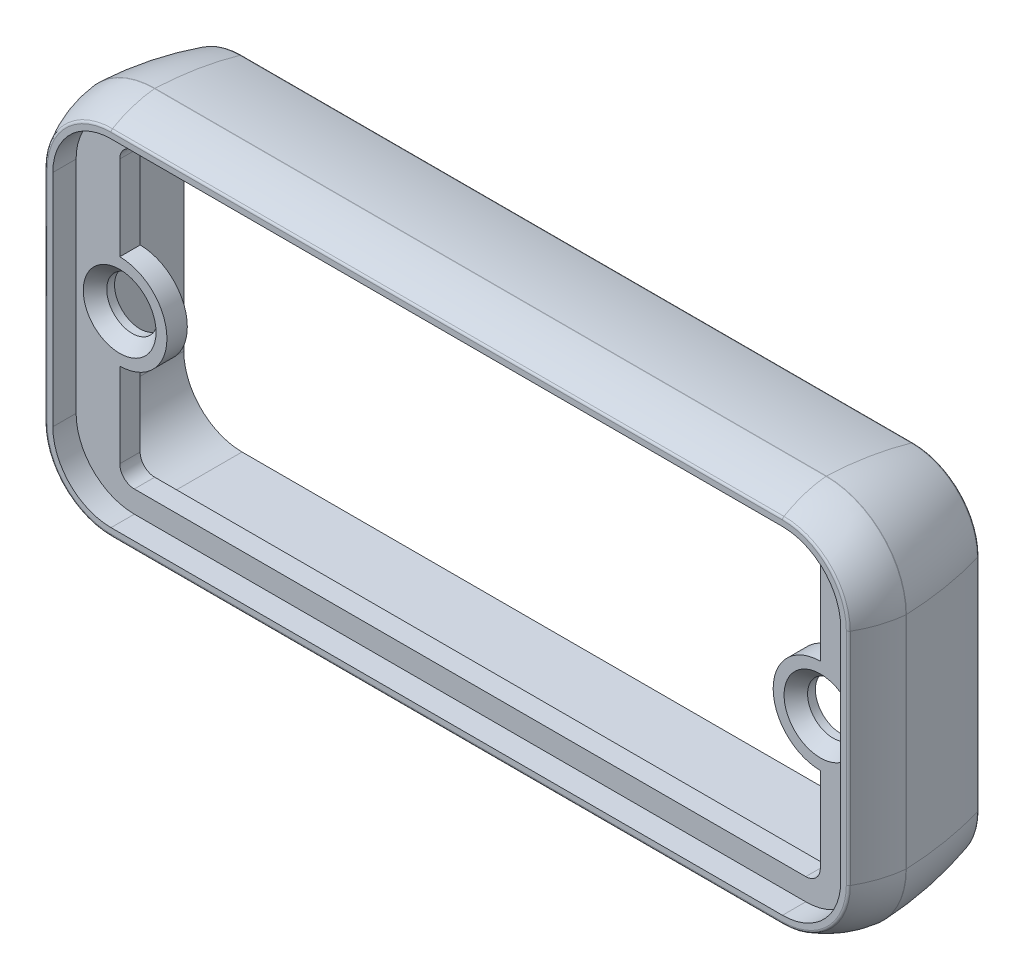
ISO-10303-21;
HEADER;
FILE_DESCRIPTION(('STEP AP214'),'2;1');
FILE_NAME('part.step','',(''),(''),'','','');
FILE_SCHEMA(('AUTOMOTIVE_DESIGN { 1 0 10303 214 1 1 1 1 }'));
ENDSEC;
DATA;
#1=APPLICATION_CONTEXT('core data for automotive mechanical design processes');
#2=APPLICATION_PROTOCOL_DEFINITION('international standard','automotive_design',2000,#1);
#3=PRODUCT_CONTEXT('',#1,'mechanical');
#4=PRODUCT('Part','Part','',(#3));
#5=PRODUCT_RELATED_PRODUCT_CATEGORY('part','',(#4));
#6=PRODUCT_DEFINITION_FORMATION('','',#4);
#7=PRODUCT_DEFINITION_CONTEXT('part definition',#1,'design');
#8=PRODUCT_DEFINITION('design','',#6,#7);
#9=PRODUCT_DEFINITION_SHAPE('','',#8);
#10=(LENGTH_UNIT() NAMED_UNIT(*) SI_UNIT(.MILLI.,.METRE.));
#11=(NAMED_UNIT(*) PLANE_ANGLE_UNIT() SI_UNIT($,.RADIAN.));
#12=(NAMED_UNIT(*) SI_UNIT($,.STERADIAN.) SOLID_ANGLE_UNIT());
#13=UNCERTAINTY_MEASURE_WITH_UNIT(LENGTH_MEASURE(1.E-05),#10,'distance_accuracy_value','');
#14=(GEOMETRIC_REPRESENTATION_CONTEXT(3) GLOBAL_UNCERTAINTY_ASSIGNED_CONTEXT((#13)) GLOBAL_UNIT_ASSIGNED_CONTEXT((#10,
#11,#12)) REPRESENTATION_CONTEXT('',''));
#15=CARTESIAN_POINT('',(0.,0.,0.));
#16=DIRECTION('',(0.,0.,1.));
#17=DIRECTION('',(1.,0.,0.));
#18=AXIS2_PLACEMENT_3D('',#15,#16,#17);
#19=CARTESIAN_POINT('',(-23.065,7.5649999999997,-0.716822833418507));
#20=DIRECTION('',(0.,0.,1.));
#21=DIRECTION('',(1.,0.,0.));
#22=AXIS2_PLACEMENT_3D('',#19,#20,#21);
#23=DEGENERATE_TOROIDAL_SURFACE('',#22,1.65046850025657,7.18630884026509,.F.);
#24=CARTESIAN_POINT('',(-23.065,7.565,0.0145970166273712));
#25=DIRECTION('',(0.,0.,-1.));
#26=DIRECTION('',(-1.,0.,0.));
#27=AXIS2_PLACEMENT_3D('',#24,#25,#26);
#28=CIRCLE('',#27,5.49852162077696);
#29=CARTESIAN_POINT('',(-28.5635216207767,7.565,0.0145970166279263));
#30=VERTEX_POINT('',#29);
#31=CARTESIAN_POINT('',(-23.065,13.0635216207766,0.0145970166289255));
#32=VERTEX_POINT('',#31);
#33=EDGE_CURVE('E343',#30,#32,#28,.T.);
#34=ORIENTED_EDGE('',*,*,#33,.F.);
#35=CARTESIAN_POINT('',(-21.4145314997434,7.5649999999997,-0.716822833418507));
#36=DIRECTION('',(0.,1.,0.));
#37=DIRECTION('',(0.,0.,1.));
#38=AXIS2_PLACEMENT_3D('',#35,#36,#37);
#39=CIRCLE('',#38,7.18630884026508);
#40=CARTESIAN_POINT('',(-27.6239377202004,7.56500000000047,2.90067756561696));
#41=VERTEX_POINT('',#40);
#42=EDGE_CURVE('E345',#41,#30,#39,.F.);
#43=ORIENTED_EDGE('',*,*,#42,.F.);
#44=CARTESIAN_POINT('',(-23.065,7.56500000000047,2.90067756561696));
#45=DIRECTION('',(0.,0.,-1.));
#46=DIRECTION('',(-1.,0.,0.));
#47=AXIS2_PLACEMENT_3D('',#44,#45,#46);
#48=CIRCLE('',#47,4.55893772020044);
#49=CARTESIAN_POINT('',(-23.065,12.1239377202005,2.90067756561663));
#50=VERTEX_POINT('',#49);
#51=EDGE_CURVE('E347',#50,#41,#48,.F.);
#52=ORIENTED_EDGE('',*,*,#51,.F.);
#53=CARTESIAN_POINT('',(-23.065,5.91453149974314,-0.71682283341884));
#54=DIRECTION('',(1.,0.,0.));
#55=DIRECTION('',(0.,0.,-1.));
#56=AXIS2_PLACEMENT_3D('',#53,#54,#55);
#57=CIRCLE('',#56,7.18630884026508);
#58=EDGE_CURVE('E514',#32,#50,#57,.T.);
#59=ORIENTED_EDGE('',*,*,#58,.F.);
#60=EDGE_LOOP('',(#34,#43,#52,#59));
#61=FACE_BOUND('',#60,.T.);
#62=ADVANCED_FACE('F24',(#61),#23,.F.);
#63=CARTESIAN_POINT('',(-21.4145314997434,-7.56500000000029,-0.71682283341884));
#64=DIRECTION('',(0.,1.,0.));
#65=DIRECTION('',(0.,0.,1.));
#66=AXIS2_PLACEMENT_3D('',#63,#64,#65);
#67=CYLINDRICAL_SURFACE('',#66,7.18630884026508);
#68=DIRECTION('',(0.,1.,0.));
#69=VECTOR('',#68,1.);
#70=CARTESIAN_POINT('',(-28.5635216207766,-7.565,0.0145970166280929));
#71=LINE('',#70,#69);
#72=CARTESIAN_POINT('',(-28.5635216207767,-7.565,0.0145970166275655));
#73=VERTEX_POINT('',#72);
#74=EDGE_CURVE('E418',#73,#30,#71,.T.);
#75=ORIENTED_EDGE('',*,*,#74,.F.);
#76=CARTESIAN_POINT('',(-21.4145314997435,-7.56500000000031,-0.71682283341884));
#77=DIRECTION('',(0.,-1.,0.));
#78=DIRECTION('',(0.,0.,-1.));
#79=AXIS2_PLACEMENT_3D('',#76,#77,#78);
#80=CIRCLE('',#79,7.18630884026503);
#81=CARTESIAN_POINT('',(-27.6239377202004,-7.56499999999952,2.90067756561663));
#82=VERTEX_POINT('',#81);
#83=EDGE_CURVE('E353',#82,#73,#80,.T.);
#84=ORIENTED_EDGE('',*,*,#83,.F.);
#85=DIRECTION('',(0.,1.,0.));
#86=VECTOR('',#85,1.);
#87=CARTESIAN_POINT('',(-27.6239377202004,-7.56499999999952,2.90067756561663));
#88=LINE('',#87,#86);
#89=EDGE_CURVE('E367',#41,#82,#88,.F.);
#90=ORIENTED_EDGE('',*,*,#89,.F.);
#91=ORIENTED_EDGE('',*,*,#42,.T.);
#92=EDGE_LOOP('',(#75,#84,#90,#91));
#93=FACE_BOUND('',#92,.T.);
#94=ADVANCED_FACE('F368',(#93),#67,.T.);
#95=CARTESIAN_POINT('',(-23.065,-7.56500000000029,-0.716822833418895));
#96=DIRECTION('',(0.,0.,1.));
#97=DIRECTION('',(1.,0.,0.));
#98=AXIS2_PLACEMENT_3D('',#95,#96,#97);
#99=DEGENERATE_TOROIDAL_SURFACE('',#98,1.65046850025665,7.18630884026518,.F.);
#100=CARTESIAN_POINT('',(-23.065,-7.565,0.0145970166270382));
#101=DIRECTION('',(0.,0.,-1.));
#102=DIRECTION('',(-1.,0.,0.));
#103=AXIS2_PLACEMENT_3D('',#100,#101,#102);
#104=CIRCLE('',#103,5.49852162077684);
#105=CARTESIAN_POINT('',(-23.065,-13.0635216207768,0.0145970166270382));
#106=VERTEX_POINT('',#105);
#107=EDGE_CURVE('E424',#106,#73,#104,.T.);
#108=ORIENTED_EDGE('',*,*,#107,.F.);
#109=CARTESIAN_POINT('',(-23.065,-5.91453149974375,-0.71682283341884));
#110=DIRECTION('',(-1.,0.,0.));
#111=DIRECTION('',(0.,0.,1.));
#112=AXIS2_PLACEMENT_3D('',#109,#110,#111);
#113=CIRCLE('',#112,7.18630884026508);
#114=CARTESIAN_POINT('',(-23.065,-12.1239377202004,2.90067756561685));
#115=VERTEX_POINT('',#114);
#116=EDGE_CURVE('E550',#115,#106,#113,.F.);
#117=ORIENTED_EDGE('',*,*,#116,.F.);
#118=CARTESIAN_POINT('',(-23.065,-7.56499999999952,2.90067756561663));
#119=DIRECTION('',(0.,0.,-1.));
#120=DIRECTION('',(-1.,0.,0.));
#121=AXIS2_PLACEMENT_3D('',#118,#119,#120);
#122=CIRCLE('',#121,4.55893772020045);
#123=EDGE_CURVE('E562',#82,#115,#122,.F.);
#124=ORIENTED_EDGE('',*,*,#123,.F.);
#125=ORIENTED_EDGE('',*,*,#83,.T.);
#126=EDGE_LOOP('',(#108,#117,#124,#125));
#127=FACE_BOUND('',#126,.T.);
#128=ADVANCED_FACE('F1271',(#127),#99,.F.);
#129=CARTESIAN_POINT('',(23.065,-5.91453149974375,-0.71682283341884));
#130=DIRECTION('',(-1.,0.,0.));
#131=DIRECTION('',(0.,0.,1.));
#132=AXIS2_PLACEMENT_3D('',#129,#130,#131);
#133=CYLINDRICAL_SURFACE('',#132,7.18630884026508);
#134=DIRECTION('',(-1.,0.,0.));
#135=VECTOR('',#134,1.);
#136=CARTESIAN_POINT('',(23.0649999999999,-13.0635216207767,0.0145970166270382));
#137=LINE('',#136,#135);
#138=CARTESIAN_POINT('',(23.065,-13.0635216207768,0.0145970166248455));
#139=VERTEX_POINT('',#138);
#140=EDGE_CURVE('E586',#139,#106,#137,.T.);
#141=ORIENTED_EDGE('',*,*,#140,.F.);
#142=CARTESIAN_POINT('',(23.065,-5.91453149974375,-0.71682283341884));
#143=DIRECTION('',(1.,0.,0.));
#144=DIRECTION('',(0.,0.,-1.));
#145=AXIS2_PLACEMENT_3D('',#142,#143,#144);
#146=CIRCLE('',#145,7.18630884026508);
#147=CARTESIAN_POINT('',(23.065,-12.1239377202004,2.90067756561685));
#148=VERTEX_POINT('',#147);
#149=EDGE_CURVE('E540',#148,#139,#146,.T.);
#150=ORIENTED_EDGE('',*,*,#149,.F.);
#151=DIRECTION('',(-1.,0.,0.));
#152=VECTOR('',#151,1.);
#153=CARTESIAN_POINT('',(23.065,-12.1239377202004,2.90067756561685));
#154=LINE('',#153,#152);
#155=EDGE_CURVE('E553',#115,#148,#154,.F.);
#156=ORIENTED_EDGE('',*,*,#155,.F.);
#157=ORIENTED_EDGE('',*,*,#116,.T.);
#158=EDGE_LOOP('',(#141,#150,#156,#157));
#159=FACE_BOUND('',#158,.T.);
#160=ADVANCED_FACE('F1272',(#159),#133,.T.);
#161=CARTESIAN_POINT('',(23.065,-7.56500000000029,-0.716822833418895));
#162=DIRECTION('',(0.,0.,1.));
#163=DIRECTION('',(1.,0.,0.));
#164=AXIS2_PLACEMENT_3D('',#161,#162,#163);
#165=DEGENERATE_TOROIDAL_SURFACE('',#164,1.65046850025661,7.18630884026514,.F.);
#166=CARTESIAN_POINT('',(23.065,-7.565,0.014597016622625));
#167=DIRECTION('',(0.,0.,-1.));
#168=DIRECTION('',(-1.,0.,0.));
#169=AXIS2_PLACEMENT_3D('',#166,#167,#168);
#170=CIRCLE('',#169,5.49852162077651);
#171=CARTESIAN_POINT('',(28.5635216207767,-7.565,0.0145970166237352));
#172=VERTEX_POINT('',#171);
#173=EDGE_CURVE('E460',#172,#139,#170,.T.);
#174=ORIENTED_EDGE('',*,*,#173,.F.);
#175=CARTESIAN_POINT('',(21.4145314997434,-7.56500000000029,-0.71682283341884));
#176=DIRECTION('',(0.,-1.,0.));
#177=DIRECTION('',(0.,0.,-1.));
#178=AXIS2_PLACEMENT_3D('',#175,#176,#177);
#179=CIRCLE('',#178,7.18630884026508);
#180=CARTESIAN_POINT('',(27.6239377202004,-7.56499999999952,2.90067756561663));
#181=VERTEX_POINT('',#180);
#182=EDGE_CURVE('E530',#181,#172,#179,.F.);
#183=ORIENTED_EDGE('',*,*,#182,.F.);
#184=CARTESIAN_POINT('',(23.065,-7.56499999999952,2.90067756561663));
#185=DIRECTION('',(0.,0.,-1.));
#186=DIRECTION('',(-1.,0.,0.));
#187=AXIS2_PLACEMENT_3D('',#184,#185,#186);
#188=CIRCLE('',#187,4.55893772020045);
#189=EDGE_CURVE('E543',#148,#181,#188,.F.);
#190=ORIENTED_EDGE('',*,*,#189,.F.);
#191=ORIENTED_EDGE('',*,*,#149,.T.);
#192=EDGE_LOOP('',(#174,#183,#190,#191));
#193=FACE_BOUND('',#192,.T.);
#194=ADVANCED_FACE('F1275',(#193),#165,.F.);
#195=CARTESIAN_POINT('',(21.4145314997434,7.56499999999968,-0.716822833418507));
#196=DIRECTION('',(0.,-1.,0.));
#197=DIRECTION('',(0.,0.,-1.));
#198=AXIS2_PLACEMENT_3D('',#195,#196,#197);
#199=CYLINDRICAL_SURFACE('',#198,7.18630884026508);
#200=DIRECTION('',(0.,-1.,0.));
#201=VECTOR('',#200,1.);
#202=CARTESIAN_POINT('',(28.5635216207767,7.56499999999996,0.0145970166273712));
#203=LINE('',#202,#201);
#204=CARTESIAN_POINT('',(28.5635216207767,7.565,0.0145970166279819));
#205=VERTEX_POINT('',#204);
#206=EDGE_CURVE('E461',#205,#172,#203,.T.);
#207=ORIENTED_EDGE('',*,*,#206,.F.);
#208=CARTESIAN_POINT('',(21.4145314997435,7.56499999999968,-0.716822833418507));
#209=DIRECTION('',(0.,1.,0.));
#210=DIRECTION('',(-1.,0.,0.));
#211=AXIS2_PLACEMENT_3D('',#208,#209,#210);
#212=CIRCLE('',#211,7.18630884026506);
#213=CARTESIAN_POINT('',(27.6239377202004,7.56500000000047,2.90067756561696));
#214=VERTEX_POINT('',#213);
#215=EDGE_CURVE('E520',#214,#205,#212,.T.);
#216=ORIENTED_EDGE('',*,*,#215,.F.);
#217=DIRECTION('',(0.,-1.,0.));
#218=VECTOR('',#217,1.);
#219=CARTESIAN_POINT('',(27.6239377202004,7.56500000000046,2.90067756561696));
#220=LINE('',#219,#218);
#221=EDGE_CURVE('E533',#181,#214,#220,.F.);
#222=ORIENTED_EDGE('',*,*,#221,.F.);
#223=ORIENTED_EDGE('',*,*,#182,.T.);
#224=EDGE_LOOP('',(#207,#216,#222,#223));
#225=FACE_BOUND('',#224,.T.);
#226=ADVANCED_FACE('F1889',(#225),#199,.T.);
#227=CARTESIAN_POINT('',(23.065,7.5649999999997,-0.716822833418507));
#228=DIRECTION('',(0.,0.,1.));
#229=DIRECTION('',(1.,0.,0.));
#230=AXIS2_PLACEMENT_3D('',#227,#228,#229);
#231=DEGENERATE_TOROIDAL_SURFACE('',#230,1.65046850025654,7.18630884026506,.F.);
#232=CARTESIAN_POINT('',(23.065,7.565,0.0145970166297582));
#233=DIRECTION('',(0.,0.,-1.));
#234=DIRECTION('',(-1.,0.,0.));
#235=AXIS2_PLACEMENT_3D('',#232,#233,#234);
#236=CIRCLE('',#235,5.49852162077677);
#237=CARTESIAN_POINT('',(23.065,13.0635216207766,0.0145970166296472));
#238=VERTEX_POINT('',#237);
#239=EDGE_CURVE('E474',#238,#205,#236,.T.);
#240=ORIENTED_EDGE('',*,*,#239,.F.);
#241=CARTESIAN_POINT('',(23.065,5.91453149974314,-0.71682283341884));
#242=DIRECTION('',(1.,0.,0.));
#243=DIRECTION('',(0.,0.,-1.));
#244=AXIS2_PLACEMENT_3D('',#241,#242,#243);
#245=CIRCLE('',#244,7.18630884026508);
#246=CARTESIAN_POINT('',(23.065,12.1239377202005,2.90067756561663));
#247=VERTEX_POINT('',#246);
#248=EDGE_CURVE('E516',#247,#238,#245,.F.);
#249=ORIENTED_EDGE('',*,*,#248,.F.);
#250=CARTESIAN_POINT('',(23.065,7.56500000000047,2.90067756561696));
#251=DIRECTION('',(0.,0.,-1.));
#252=DIRECTION('',(-1.,0.,0.));
#253=AXIS2_PLACEMENT_3D('',#250,#251,#252);
#254=CIRCLE('',#253,4.55893772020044);
#255=EDGE_CURVE('E523',#214,#247,#254,.F.);
#256=ORIENTED_EDGE('',*,*,#255,.F.);
#257=ORIENTED_EDGE('',*,*,#215,.T.);
#258=EDGE_LOOP('',(#240,#249,#256,#257));
#259=FACE_BOUND('',#258,.T.);
#260=ADVANCED_FACE('F1882',(#259),#231,.F.);
#261=CARTESIAN_POINT('',(-23.065,5.91453149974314,-0.71682283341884));
#262=DIRECTION('',(1.,0.,0.));
#263=DIRECTION('',(0.,0.,-1.));
#264=AXIS2_PLACEMENT_3D('',#261,#262,#263);
#265=CYLINDRICAL_SURFACE('',#264,7.18630884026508);
#266=DIRECTION('',(1.,0.,0.));
#267=VECTOR('',#266,1.);
#268=CARTESIAN_POINT('',(-23.065,13.0635216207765,0.0145970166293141));
#269=LINE('',#268,#267);
#270=EDGE_CURVE('E604',#32,#238,#269,.T.);
#271=ORIENTED_EDGE('',*,*,#270,.F.);
#272=ORIENTED_EDGE('',*,*,#58,.T.);
#273=DIRECTION('',(1.,0.,0.));
#274=VECTOR('',#273,1.);
#275=CARTESIAN_POINT('',(-23.065,12.1239377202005,2.90067756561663));
#276=LINE('',#275,#274);
#277=EDGE_CURVE('E509',#247,#50,#276,.F.);
#278=ORIENTED_EDGE('',*,*,#277,.F.);
#279=ORIENTED_EDGE('',*,*,#248,.T.);
#280=EDGE_LOOP('',(#271,#272,#278,#279));
#281=FACE_BOUND('',#280,.T.);
#282=ADVANCED_FACE('F499',(#281),#265,.T.);
#283=CARTESIAN_POINT('',(-23.065,7.565,-0.00575890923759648));
#284=DIRECTION('',(0.,0.,-1.));
#285=DIRECTION('',(-1.,0.,0.));
#286=AXIS2_PLACEMENT_3D('',#283,#284,#285);
#287=TOROIDAL_SURFACE('',#286,5.29956022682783,0.2);
#288=CARTESIAN_POINT('',(-23.065,12.8645602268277,-0.00575890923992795));
#289=DIRECTION('',(1.,0.,0.));
#290=DIRECTION('',(0.,0.,-1.));
#291=AXIS2_PLACEMENT_3D('',#288,#289,#290);
#292=CIRCLE('',#291,0.2);
#293=CARTESIAN_POINT('',(-23.065,13.0643686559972,-0.0145105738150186));
#294=VERTEX_POINT('',#293);
#295=EDGE_CURVE('E575',#294,#32,#292,.T.);
#296=ORIENTED_EDGE('',*,*,#295,.F.);
#297=CARTESIAN_POINT('',(-23.065,7.565,-0.0145105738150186));
#298=DIRECTION('',(0.,0.,-1.));
#299=DIRECTION('',(-1.,0.,0.));
#300=AXIS2_PLACEMENT_3D('',#297,#298,#299);
#301=CIRCLE('',#300,5.49936865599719);
#302=CARTESIAN_POINT('',(-28.5643686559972,7.565,-0.0145105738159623));
#303=VERTEX_POINT('',#302);
#304=EDGE_CURVE('E398',#303,#294,#301,.T.);
#305=ORIENTED_EDGE('',*,*,#304,.F.);
#306=CARTESIAN_POINT('',(-28.3645602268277,7.565,-0.00575890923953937));
#307=DIRECTION('',(0.,1.,0.));
#308=DIRECTION('',(0.,0.,1.));
#309=AXIS2_PLACEMENT_3D('',#306,#307,#308);
#310=CIRCLE('',#309,0.2);
#311=EDGE_CURVE('E364',#30,#303,#310,.F.);
#312=ORIENTED_EDGE('',*,*,#311,.F.);
#313=ORIENTED_EDGE('',*,*,#33,.T.);
#314=EDGE_LOOP('',(#296,#305,#312,#313));
#315=FACE_BOUND('',#314,.T.);
#316=ADVANCED_FACE('F494',(#315),#287,.T.);
#317=CARTESIAN_POINT('',(-23.065,12.8645602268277,-0.00575890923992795));
#318=DIRECTION('',(1.,0.,0.));
#319=DIRECTION('',(0.,0.,-1.));
#320=AXIS2_PLACEMENT_3D('',#317,#318,#319);
#321=CYLINDRICAL_SURFACE('',#320,0.2);
#322=CARTESIAN_POINT('',(23.065,12.8645602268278,-0.00575890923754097));
#323=DIRECTION('',(1.,0.,0.));
#324=DIRECTION('',(0.,1.,0.));
#325=AXIS2_PLACEMENT_3D('',#322,#323,#324);
#326=CIRCLE('',#325,0.2);
#327=CARTESIAN_POINT('',(23.065,13.0643686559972,-0.0145105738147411));
#328=VERTEX_POINT('',#327);
#329=EDGE_CURVE('E485',#328,#238,#326,.T.);
#330=ORIENTED_EDGE('',*,*,#329,.F.);
#331=DIRECTION('',(1.,0.,0.));
#332=VECTOR('',#331,1.);
#333=CARTESIAN_POINT('',(-23.065,13.0643686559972,-0.0145105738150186));
#334=LINE('',#333,#332);
#335=EDGE_CURVE('E808',#294,#328,#334,.T.);
#336=ORIENTED_EDGE('',*,*,#335,.F.);
#337=ORIENTED_EDGE('',*,*,#295,.T.);
#338=ORIENTED_EDGE('',*,*,#270,.T.);
#339=EDGE_LOOP('',(#330,#336,#337,#338));
#340=FACE_BOUND('',#339,.T.);
#341=ADVANCED_FACE('F490',(#340),#321,.T.);
#342=CARTESIAN_POINT('',(23.065,7.565,-0.0057589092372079));
#343=DIRECTION('',(0.,0.,-1.));
#344=DIRECTION('',(-1.,0.,0.));
#345=AXIS2_PLACEMENT_3D('',#342,#343,#344);
#346=TOROIDAL_SURFACE('',#345,5.29956022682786,0.2);
#347=CARTESIAN_POINT('',(28.3645602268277,7.565,-0.00575890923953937));
#348=DIRECTION('',(0.,-1.,0.));
#349=DIRECTION('',(0.,0.,-1.));
#350=AXIS2_PLACEMENT_3D('',#347,#348,#349);
#351=CIRCLE('',#350,0.2);
#352=CARTESIAN_POINT('',(28.5643686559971,7.565,-0.0145105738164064));
#353=VERTEX_POINT('',#352);
#354=EDGE_CURVE('E471',#353,#205,#351,.T.);
#355=ORIENTED_EDGE('',*,*,#354,.F.);
#356=CARTESIAN_POINT('',(23.065,7.565,-0.0145105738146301));
#357=DIRECTION('',(0.,0.,-1.));
#358=DIRECTION('',(-1.,0.,0.));
#359=AXIS2_PLACEMENT_3D('',#356,#357,#358);
#360=CIRCLE('',#359,5.49936865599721);
#361=EDGE_CURVE('E477',#328,#353,#360,.T.);
#362=ORIENTED_EDGE('',*,*,#361,.F.);
#363=ORIENTED_EDGE('',*,*,#329,.T.);
#364=ORIENTED_EDGE('',*,*,#239,.T.);
#365=EDGE_LOOP('',(#355,#362,#363,#364));
#366=FACE_BOUND('',#365,.T.);
#367=ADVANCED_FACE('F487',(#366),#346,.T.);
#368=CARTESIAN_POINT('',(28.3645602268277,7.56499999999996,-0.00575890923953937));
#369=DIRECTION('',(0.,-1.,0.));
#370=DIRECTION('',(0.,0.,-1.));
#371=AXIS2_PLACEMENT_3D('',#368,#369,#370);
#372=CYLINDRICAL_SURFACE('',#371,0.2);
#373=CARTESIAN_POINT('',(28.3645602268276,-7.565,-0.00575890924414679));
#374=DIRECTION('',(0.,-1.,0.));
#375=DIRECTION('',(1.,0.,0.));
#376=AXIS2_PLACEMENT_3D('',#373,#374,#375);
#377=CIRCLE('',#376,0.2);
#378=CARTESIAN_POINT('',(28.5643686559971,-7.565,-0.0145105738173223));
#379=VERTEX_POINT('',#378);
#380=EDGE_CURVE('E457',#379,#172,#377,.T.);
#381=ORIENTED_EDGE('',*,*,#380,.F.);
#382=DIRECTION('',(0.,-1.,0.));
#383=VECTOR('',#382,1.);
#384=CARTESIAN_POINT('',(28.5643686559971,7.56499999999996,-0.014510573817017));
#385=LINE('',#384,#383);
#386=EDGE_CURVE('E464',#353,#379,#385,.T.);
#387=ORIENTED_EDGE('',*,*,#386,.F.);
#388=ORIENTED_EDGE('',*,*,#354,.T.);
#389=ORIENTED_EDGE('',*,*,#206,.T.);
#390=EDGE_LOOP('',(#381,#387,#388,#389));
#391=FACE_BOUND('',#390,.T.);
#392=ADVANCED_FACE('F449',(#391),#372,.T.);
#393=CARTESIAN_POINT('',(23.065,-7.565,-0.00575890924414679));
#394=DIRECTION('',(0.,0.,-1.));
#395=DIRECTION('',(-1.,0.,0.));
#396=AXIS2_PLACEMENT_3D('',#393,#394,#395);
#397=TOROIDAL_SURFACE('',#396,5.29956022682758,0.2);
#398=CARTESIAN_POINT('',(23.065,-12.8645602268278,-0.00575890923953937));
#399=DIRECTION('',(-1.,0.,0.));
#400=DIRECTION('',(0.,0.,1.));
#401=AXIS2_PLACEMENT_3D('',#398,#399,#400);
#402=CIRCLE('',#401,0.2);
#403=CARTESIAN_POINT('',(23.065,-13.0643686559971,-0.0145105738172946));
#404=VERTEX_POINT('',#403);
#405=EDGE_CURVE('E589',#404,#139,#402,.T.);
#406=ORIENTED_EDGE('',*,*,#405,.F.);
#407=CARTESIAN_POINT('',(23.065,-7.565,-0.0145105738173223));
#408=DIRECTION('',(0.,0.,-1.));
#409=DIRECTION('',(-1.,0.,0.));
#410=AXIS2_PLACEMENT_3D('',#407,#408,#409);
#411=CIRCLE('',#410,5.49936865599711);
#412=EDGE_CURVE('E777',#379,#404,#411,.T.);
#413=ORIENTED_EDGE('',*,*,#412,.F.);
#414=ORIENTED_EDGE('',*,*,#380,.T.);
#415=ORIENTED_EDGE('',*,*,#173,.T.);
#416=EDGE_LOOP('',(#406,#413,#414,#415));
#417=FACE_BOUND('',#416,.T.);
#418=ADVANCED_FACE('F444',(#417),#397,.T.);
#419=CARTESIAN_POINT('',(23.0649999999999,-12.8645602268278,-0.00575890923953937));
#420=DIRECTION('',(-1.,0.,0.));
#421=DIRECTION('',(0.,0.,1.));
#422=AXIS2_PLACEMENT_3D('',#419,#420,#421);
#423=CYLINDRICAL_SURFACE('',#422,0.2);
#424=CARTESIAN_POINT('',(-23.065,-12.8645602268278,-0.00575890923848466));
#425=DIRECTION('',(-1.,0.,0.));
#426=DIRECTION('',(0.,-1.,0.));
#427=AXIS2_PLACEMENT_3D('',#424,#425,#426);
#428=CIRCLE('',#427,0.2);
#429=CARTESIAN_POINT('',(-23.065,-13.0643686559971,-0.0145105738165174));
#430=VERTEX_POINT('',#429);
#431=EDGE_CURVE('E435',#430,#106,#428,.T.);
#432=ORIENTED_EDGE('',*,*,#431,.F.);
#433=DIRECTION('',(-1.,0.,0.));
#434=VECTOR('',#433,1.);
#435=CARTESIAN_POINT('',(23.0649999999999,-13.0643686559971,-0.0145105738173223));
#436=LINE('',#435,#434);
#437=EDGE_CURVE('E765',#404,#430,#436,.T.);
#438=ORIENTED_EDGE('',*,*,#437,.F.);
#439=ORIENTED_EDGE('',*,*,#405,.T.);
#440=ORIENTED_EDGE('',*,*,#140,.T.);
#441=EDGE_LOOP('',(#432,#438,#439,#440));
#442=FACE_BOUND('',#441,.T.);
#443=ADVANCED_FACE('F440',(#442),#423,.T.);
#444=CARTESIAN_POINT('',(-23.065,-7.565,-0.00575890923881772));
#445=DIRECTION('',(0.,0.,-1.));
#446=DIRECTION('',(-1.,0.,0.));
#447=AXIS2_PLACEMENT_3D('',#444,#445,#446);
#448=TOROIDAL_SURFACE('',#447,5.2995602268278,0.2);
#449=CARTESIAN_POINT('',(-28.3645602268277,-7.565,-0.00575890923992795));
#450=DIRECTION('',(0.,1.,0.));
#451=DIRECTION('',(0.,0.,1.));
#452=AXIS2_PLACEMENT_3D('',#449,#450,#451);
#453=CIRCLE('',#452,0.2);
#454=CARTESIAN_POINT('',(-28.5643686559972,-7.565,-0.0145105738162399));
#455=VERTEX_POINT('',#454);
#456=EDGE_CURVE('E421',#455,#73,#453,.T.);
#457=ORIENTED_EDGE('',*,*,#456,.F.);
#458=CARTESIAN_POINT('',(-23.065,-7.565,-0.0145105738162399));
#459=DIRECTION('',(0.,0.,-1.));
#460=DIRECTION('',(-1.,0.,0.));
#461=AXIS2_PLACEMENT_3D('',#458,#459,#460);
#462=CIRCLE('',#461,5.49936865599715);
#463=EDGE_CURVE('E427',#430,#455,#462,.T.);
#464=ORIENTED_EDGE('',*,*,#463,.F.);
#465=ORIENTED_EDGE('',*,*,#431,.T.);
#466=ORIENTED_EDGE('',*,*,#107,.T.);
#467=EDGE_LOOP('',(#457,#464,#465,#466));
#468=FACE_BOUND('',#467,.T.);
#469=ADVANCED_FACE('F437',(#468),#448,.T.);
#470=CARTESIAN_POINT('',(-28.3645602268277,-7.565,-0.00575890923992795));
#471=DIRECTION('',(0.,1.,0.));
#472=DIRECTION('',(0.,0.,1.));
#473=AXIS2_PLACEMENT_3D('',#470,#471,#472);
#474=CYLINDRICAL_SURFACE('',#473,0.2);
#475=ORIENTED_EDGE('',*,*,#311,.T.);
#476=DIRECTION('',(0.,1.,0.));
#477=VECTOR('',#476,1.);
#478=CARTESIAN_POINT('',(-28.5643686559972,-7.565,-0.0145105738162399));
#479=LINE('',#478,#477);
#480=EDGE_CURVE('E409',#455,#303,#479,.T.);
#481=ORIENTED_EDGE('',*,*,#480,.F.);
#482=ORIENTED_EDGE('',*,*,#456,.T.);
#483=ORIENTED_EDGE('',*,*,#74,.T.);
#484=EDGE_LOOP('',(#475,#481,#482,#483));
#485=FACE_BOUND('',#484,.T.);
#486=ADVANCED_FACE('F392',(#485),#474,.T.);
#487=CARTESIAN_POINT('',(-23.065,7.56500000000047,2.80000000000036));
#488=DIRECTION('',(0.,0.,-1.));
#489=DIRECTION('',(-1.,0.,0.));
#490=AXIS2_PLACEMENT_3D('',#487,#488,#489);
#491=TOROIDAL_SURFACE('',#490,4.38612560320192,0.2);
#492=CARTESIAN_POINT('',(-23.065,11.9511256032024,2.8));
#493=DIRECTION('',(1.,0.,0.));
#494=DIRECTION('',(0.,0.,-1.));
#495=AXIS2_PLACEMENT_3D('',#492,#493,#494);
#496=CIRCLE('',#495,0.2);
#497=CARTESIAN_POINT('',(-23.065,11.9511256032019,3.));
#498=VERTEX_POINT('',#497);
#499=EDGE_CURVE('E362',#50,#498,#496,.T.);
#500=ORIENTED_EDGE('',*,*,#499,.F.);
#501=ORIENTED_EDGE('',*,*,#51,.T.);
#502=CARTESIAN_POINT('',(-27.4511256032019,7.56500000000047,2.80000000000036));
#503=DIRECTION('',(0.,1.,0.));
#504=DIRECTION('',(0.,0.,1.));
#505=AXIS2_PLACEMENT_3D('',#502,#503,#504);
#506=CIRCLE('',#505,0.2);
#507=CARTESIAN_POINT('',(-27.4511256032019,7.56500000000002,3.00000000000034));
#508=VERTEX_POINT('',#507);
#509=EDGE_CURVE('E359',#508,#41,#506,.F.);
#510=ORIENTED_EDGE('',*,*,#509,.F.);
#511=CARTESIAN_POINT('',(-23.065,7.56500000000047,3.00000000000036));
#512=DIRECTION('',(0.,0.,-1.));
#513=DIRECTION('',(-1.,0.,0.));
#514=AXIS2_PLACEMENT_3D('',#511,#512,#513);
#515=CIRCLE('',#514,4.38612560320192);
#516=EDGE_CURVE('E750',#498,#508,#515,.F.);
#517=ORIENTED_EDGE('',*,*,#516,.F.);
#518=EDGE_LOOP('',(#500,#501,#510,#517));
#519=FACE_BOUND('',#518,.T.);
#520=ADVANCED_FACE('F357',(#519),#491,.T.);
#521=CARTESIAN_POINT('',(-27.4511256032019,-7.56499999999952,2.8));
#522=DIRECTION('',(0.,1.,0.));
#523=DIRECTION('',(0.,0.,1.));
#524=AXIS2_PLACEMENT_3D('',#521,#522,#523);
#525=CYLINDRICAL_SURFACE('',#524,0.2);
#526=ORIENTED_EDGE('',*,*,#509,.T.);
#527=ORIENTED_EDGE('',*,*,#89,.T.);
#528=CARTESIAN_POINT('',(-27.4511256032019,-7.56499999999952,2.8));
#529=DIRECTION('',(0.,1.,0.));
#530=DIRECTION('',(-1.,0.,0.));
#531=AXIS2_PLACEMENT_3D('',#528,#529,#530);
#532=CIRCLE('',#531,0.2);
#533=CARTESIAN_POINT('',(-27.4511256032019,-7.56499999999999,3.));
#534=VERTEX_POINT('',#533);
#535=EDGE_CURVE('E371',#534,#82,#532,.F.);
#536=ORIENTED_EDGE('',*,*,#535,.F.);
#537=DIRECTION('',(0.,1.,0.));
#538=VECTOR('',#537,1.);
#539=CARTESIAN_POINT('',(-27.4511256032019,7.56500000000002,3.00000000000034));
#540=LINE('',#539,#538);
#541=EDGE_CURVE('E375',#508,#534,#540,.F.);
#542=ORIENTED_EDGE('',*,*,#541,.F.);
#543=EDGE_LOOP('',(#526,#527,#536,#542));
#544=FACE_BOUND('',#543,.T.);
#545=ADVANCED_FACE('F373',(#544),#525,.T.);
#546=CARTESIAN_POINT('',(-23.065,-7.56499999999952,2.8));
#547=DIRECTION('',(0.,0.,-1.));
#548=DIRECTION('',(-1.,0.,0.));
#549=AXIS2_PLACEMENT_3D('',#546,#547,#548);
#550=TOROIDAL_SURFACE('',#549,4.38612560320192,0.2);
#551=ORIENTED_EDGE('',*,*,#535,.T.);
#552=ORIENTED_EDGE('',*,*,#123,.T.);
#553=CARTESIAN_POINT('',(-23.065,-11.9511256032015,2.8));
#554=DIRECTION('',(-1.,0.,0.));
#555=DIRECTION('',(0.,0.,1.));
#556=AXIS2_PLACEMENT_3D('',#553,#554,#555);
#557=CIRCLE('',#556,0.2);
#558=CARTESIAN_POINT('',(-23.065,-11.9511256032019,3.));
#559=VERTEX_POINT('',#558);
#560=EDGE_CURVE('E556',#559,#115,#557,.F.);
#561=ORIENTED_EDGE('',*,*,#560,.F.);
#562=CARTESIAN_POINT('',(-23.065,-7.56499999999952,3.));
#563=DIRECTION('',(0.,0.,-1.));
#564=DIRECTION('',(0.,-1.,0.));
#565=AXIS2_PLACEMENT_3D('',#562,#563,#564);
#566=CIRCLE('',#565,4.38612560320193);
#567=EDGE_CURVE('E902',#534,#559,#566,.F.);
#568=ORIENTED_EDGE('',*,*,#567,.F.);
#569=EDGE_LOOP('',(#551,#552,#561,#568));
#570=FACE_BOUND('',#569,.T.);
#571=ADVANCED_FACE('F888',(#570),#550,.T.);
#572=CARTESIAN_POINT('',(23.065,-11.9511256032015,2.8));
#573=DIRECTION('',(-1.,0.,0.));
#574=DIRECTION('',(0.,0.,1.));
#575=AXIS2_PLACEMENT_3D('',#572,#573,#574);
#576=CYLINDRICAL_SURFACE('',#575,0.2);
#577=ORIENTED_EDGE('',*,*,#560,.T.);
#578=ORIENTED_EDGE('',*,*,#155,.T.);
#579=CARTESIAN_POINT('',(23.065,-11.9511256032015,2.8));
#580=DIRECTION('',(-1.,0.,0.));
#581=DIRECTION('',(0.,-1.,0.));
#582=AXIS2_PLACEMENT_3D('',#579,#580,#581);
#583=CIRCLE('',#582,0.2);
#584=CARTESIAN_POINT('',(23.065,-11.9511256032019,3.));
#585=VERTEX_POINT('',#584);
#586=EDGE_CURVE('E546',#585,#148,#583,.F.);
#587=ORIENTED_EDGE('',*,*,#586,.F.);
#588=DIRECTION('',(1.,0.,0.));
#589=VECTOR('',#588,1.);
#590=CARTESIAN_POINT('',(-27.315,-11.9511256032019,3.));
#591=LINE('',#590,#589);
#592=EDGE_CURVE('E907',#559,#585,#591,.T.);
#593=ORIENTED_EDGE('',*,*,#592,.F.);
#594=EDGE_LOOP('',(#577,#578,#587,#593));
#595=FACE_BOUND('',#594,.T.);
#596=ADVANCED_FACE('F866',(#595),#576,.T.);
#597=CARTESIAN_POINT('',(23.065,-7.56499999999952,2.8));
#598=DIRECTION('',(0.,0.,-1.));
#599=DIRECTION('',(-1.,0.,0.));
#600=AXIS2_PLACEMENT_3D('',#597,#598,#599);
#601=TOROIDAL_SURFACE('',#600,4.38612560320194,0.2);
#602=CARTESIAN_POINT('',(27.4511256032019,-7.56499999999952,2.8));
#603=DIRECTION('',(0.,-1.,0.));
#604=DIRECTION('',(0.,0.,-1.));
#605=AXIS2_PLACEMENT_3D('',#602,#603,#604);
#606=CIRCLE('',#605,0.2);
#607=CARTESIAN_POINT('',(27.4511256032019,-7.56499999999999,3.));
#608=VERTEX_POINT('',#607);
#609=EDGE_CURVE('E536',#608,#181,#606,.F.);
#610=ORIENTED_EDGE('',*,*,#609,.F.);
#611=CARTESIAN_POINT('',(23.065,-7.56499999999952,3.));
#612=DIRECTION('',(0.,0.,-1.));
#613=DIRECTION('',(1.,0.,0.));
#614=AXIS2_PLACEMENT_3D('',#611,#612,#613);
#615=CIRCLE('',#614,4.38612560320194);
#616=EDGE_CURVE('E1060',#585,#608,#615,.F.);
#617=ORIENTED_EDGE('',*,*,#616,.F.);
#618=ORIENTED_EDGE('',*,*,#586,.T.);
#619=ORIENTED_EDGE('',*,*,#189,.T.);
#620=EDGE_LOOP('',(#610,#617,#618,#619));
#621=FACE_BOUND('',#620,.T.);
#622=ADVANCED_FACE('F862',(#621),#601,.T.);
#623=CARTESIAN_POINT('',(27.4511256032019,7.56500000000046,2.80000000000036));
#624=DIRECTION('',(0.,-1.,0.));
#625=DIRECTION('',(0.,0.,-1.));
#626=AXIS2_PLACEMENT_3D('',#623,#624,#625);
#627=CYLINDRICAL_SURFACE('',#626,0.2);
#628=CARTESIAN_POINT('',(27.4511256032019,7.56500000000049,2.80000000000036));
#629=DIRECTION('',(0.,-1.,0.));
#630=DIRECTION('',(1.,0.,0.));
#631=AXIS2_PLACEMENT_3D('',#628,#629,#630);
#632=CIRCLE('',#631,0.2);
#633=CARTESIAN_POINT('',(27.4511256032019,7.56500000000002,3.00000000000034));
#634=VERTEX_POINT('',#633);
#635=EDGE_CURVE('E526',#634,#214,#632,.F.);
#636=ORIENTED_EDGE('',*,*,#635,.F.);
#637=DIRECTION('',(0.,1.,0.));
#638=VECTOR('',#637,1.);
#639=CARTESIAN_POINT('',(27.4511256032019,7.56500000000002,3.00000000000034));
#640=LINE('',#639,#638);
#641=EDGE_CURVE('E1082',#608,#634,#640,.T.);
#642=ORIENTED_EDGE('',*,*,#641,.F.);
#643=ORIENTED_EDGE('',*,*,#609,.T.);
#644=ORIENTED_EDGE('',*,*,#221,.T.);
#645=EDGE_LOOP('',(#636,#642,#643,#644));
#646=FACE_BOUND('',#645,.T.);
#647=ADVANCED_FACE('F838',(#646),#627,.T.);
#648=CARTESIAN_POINT('',(23.065,7.56500000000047,2.80000000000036));
#649=DIRECTION('',(0.,0.,-1.));
#650=DIRECTION('',(-1.,0.,0.));
#651=AXIS2_PLACEMENT_3D('',#648,#649,#650);
#652=TOROIDAL_SURFACE('',#651,4.38612560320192,0.2);
#653=CARTESIAN_POINT('',(23.065,11.9511256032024,2.8));
#654=DIRECTION('',(1.,0.,0.));
#655=DIRECTION('',(0.,0.,-1.));
#656=AXIS2_PLACEMENT_3D('',#653,#654,#655);
#657=CIRCLE('',#656,0.2);
#658=CARTESIAN_POINT('',(23.065,11.9511256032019,3.));
#659=VERTEX_POINT('',#658);
#660=EDGE_CURVE('E511',#659,#247,#657,.F.);
#661=ORIENTED_EDGE('',*,*,#660,.F.);
#662=CARTESIAN_POINT('',(23.065,7.56500000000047,3.00000000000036));
#663=DIRECTION('',(0.,0.,-1.));
#664=DIRECTION('',(0.,1.,0.));
#665=AXIS2_PLACEMENT_3D('',#662,#663,#664);
#666=CIRCLE('',#665,4.38612560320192);
#667=EDGE_CURVE('E1070',#634,#659,#666,.F.);
#668=ORIENTED_EDGE('',*,*,#667,.F.);
#669=ORIENTED_EDGE('',*,*,#635,.T.);
#670=ORIENTED_EDGE('',*,*,#255,.T.);
#671=EDGE_LOOP('',(#661,#668,#669,#670));
#672=FACE_BOUND('',#671,.T.);
#673=ADVANCED_FACE('F832',(#672),#652,.T.);
#674=CARTESIAN_POINT('',(-23.065,11.9511256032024,2.8));
#675=DIRECTION('',(1.,0.,0.));
#676=DIRECTION('',(0.,0.,-1.));
#677=AXIS2_PLACEMENT_3D('',#674,#675,#676);
#678=CYLINDRICAL_SURFACE('',#677,0.2);
#679=ORIENTED_EDGE('',*,*,#499,.T.);
#680=DIRECTION('',(1.,0.,0.));
#681=VECTOR('',#680,1.);
#682=CARTESIAN_POINT('',(-27.315,11.9511256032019,3.));
#683=LINE('',#682,#681);
#684=EDGE_CURVE('E738',#659,#498,#683,.F.);
#685=ORIENTED_EDGE('',*,*,#684,.F.);
#686=ORIENTED_EDGE('',*,*,#660,.T.);
#687=ORIENTED_EDGE('',*,*,#277,.T.);
#688=EDGE_LOOP('',(#679,#685,#686,#687));
#689=FACE_BOUND('',#688,.T.);
#690=ADVANCED_FACE('F837',(#689),#678,.T.);
#691=CARTESIAN_POINT('',(-23.065,7.56499999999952,1.07944749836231));
#692=DIRECTION('',(0.,0.,1.));
#693=DIRECTION('',(1.,0.,0.));
#694=AXIS2_PLACEMENT_3D('',#691,#692,#693);
#695=DEGENERATE_TOROIDAL_SURFACE('',#694,19.4766849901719,25.,.F.);
#696=ORIENTED_EDGE('',*,*,#304,.T.);
#697=CARTESIAN_POINT('',(-23.065,-11.9116849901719,1.07944749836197));
#698=DIRECTION('',(1.,0.,0.));
#699=DIRECTION('',(0.,0.,-1.));
#700=AXIS2_PLACEMENT_3D('',#697,#698,#699);
#701=CIRCLE('',#700,25.);
#702=CARTESIAN_POINT('',(-23.065,12.1071990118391,-5.85547941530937));
#703=VERTEX_POINT('',#702);
#704=EDGE_CURVE('E406',#703,#294,#701,.T.);
#705=ORIENTED_EDGE('',*,*,#704,.F.);
#706=CARTESIAN_POINT('',(-23.065,7.56500000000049,-5.85547941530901));
#707=DIRECTION('',(0.,0.,-1.));
#708=DIRECTION('',(-1.,0.,0.));
#709=AXIS2_PLACEMENT_3D('',#706,#707,#708);
#710=CIRCLE('',#709,4.54219901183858);
#711=CARTESIAN_POINT('',(-27.6071990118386,7.56500000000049,-5.85547941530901));
#712=VERTEX_POINT('',#711);
#713=EDGE_CURVE('E224',#712,#703,#710,.T.);
#714=ORIENTED_EDGE('',*,*,#713,.F.);
#715=CARTESIAN_POINT('',(-3.58831500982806,7.56499999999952,1.07944749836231));
#716=DIRECTION('',(0.,1.,0.));
#717=DIRECTION('',(0.,0.,1.));
#718=AXIS2_PLACEMENT_3D('',#715,#716,#717);
#719=CIRCLE('',#718,25.);
#720=EDGE_CURVE('E412',#303,#712,#719,.F.);
#721=ORIENTED_EDGE('',*,*,#720,.F.);
#722=EDGE_LOOP('',(#696,#705,#714,#721));
#723=FACE_BOUND('',#722,.T.);
#724=ADVANCED_FACE('F1782',(#723),#695,.F.);
#725=CARTESIAN_POINT('',(-23.065,-11.9116849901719,1.07944749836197));
#726=DIRECTION('',(1.,0.,0.));
#727=DIRECTION('',(0.,0.,-1.));
#728=AXIS2_PLACEMENT_3D('',#725,#726,#727);
#729=CYLINDRICAL_SURFACE('',#728,25.);
#730=ORIENTED_EDGE('',*,*,#335,.T.);
#731=CARTESIAN_POINT('',(23.065,-11.9116849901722,1.07944749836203));
#732=DIRECTION('',(1.,0.,0.));
#733=DIRECTION('',(0.,0.,-1.));
#734=AXIS2_PLACEMENT_3D('',#731,#732,#733);
#735=CIRCLE('',#734,25.0000000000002);
#736=CARTESIAN_POINT('',(23.065,12.1071990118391,-5.85547941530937));
#737=VERTEX_POINT('',#736);
#738=EDGE_CURVE('E480',#737,#328,#735,.T.);
#739=ORIENTED_EDGE('',*,*,#738,.F.);
#740=DIRECTION('',(1.,0.,0.));
#741=VECTOR('',#740,1.);
#742=CARTESIAN_POINT('',(-23.065,12.1071990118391,-5.85547941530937));
#743=LINE('',#742,#741);
#744=EDGE_CURVE('E811',#703,#737,#743,.T.);
#745=ORIENTED_EDGE('',*,*,#744,.F.);
#746=ORIENTED_EDGE('',*,*,#704,.T.);
#747=EDGE_LOOP('',(#730,#739,#745,#746));
#748=FACE_BOUND('',#747,.T.);
#749=ADVANCED_FACE('F1287',(#748),#729,.T.);
#750=CARTESIAN_POINT('',(23.065,7.56499999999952,1.07944749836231));
#751=DIRECTION('',(0.,0.,1.));
#752=DIRECTION('',(1.,0.,0.));
#753=AXIS2_PLACEMENT_3D('',#750,#751,#752);
#754=DEGENERATE_TOROIDAL_SURFACE('',#753,19.4766849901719,25.,.F.);
#755=ORIENTED_EDGE('',*,*,#361,.T.);
#756=CARTESIAN_POINT('',(3.58831500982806,7.56499999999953,1.07944749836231));
#757=DIRECTION('',(0.,-1.,0.));
#758=DIRECTION('',(0.,0.,-1.));
#759=AXIS2_PLACEMENT_3D('',#756,#757,#758);
#760=CIRCLE('',#759,25.);
#761=CARTESIAN_POINT('',(27.6071990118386,7.56500000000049,-5.85547941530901));
#762=VERTEX_POINT('',#761);
#763=EDGE_CURVE('E468',#762,#353,#760,.T.);
#764=ORIENTED_EDGE('',*,*,#763,.F.);
#765=CARTESIAN_POINT('',(23.065,7.56500000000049,-5.85547941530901));
#766=DIRECTION('',(0.,0.,-1.));
#767=DIRECTION('',(-1.,0.,0.));
#768=AXIS2_PLACEMENT_3D('',#765,#766,#767);
#769=CIRCLE('',#768,4.54219901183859);
#770=EDGE_CURVE('E800',#737,#762,#769,.T.);
#771=ORIENTED_EDGE('',*,*,#770,.F.);
#772=ORIENTED_EDGE('',*,*,#738,.T.);
#773=EDGE_LOOP('',(#755,#764,#771,#772));
#774=FACE_BOUND('',#773,.T.);
#775=ADVANCED_FACE('F1252',(#774),#754,.F.);
#776=CARTESIAN_POINT('',(3.58831500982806,7.56499999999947,1.07944749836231));
#777=DIRECTION('',(0.,-1.,0.));
#778=DIRECTION('',(0.,0.,-1.));
#779=AXIS2_PLACEMENT_3D('',#776,#777,#778);
#780=CYLINDRICAL_SURFACE('',#779,25.);
#781=ORIENTED_EDGE('',*,*,#386,.T.);
#782=CARTESIAN_POINT('',(3.58831500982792,-7.56500000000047,1.07944749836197));
#783=DIRECTION('',(0.,-1.,0.));
#784=DIRECTION('',(0.,0.,-1.));
#785=AXIS2_PLACEMENT_3D('',#782,#783,#784);
#786=CIRCLE('',#785,25.0000000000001);
#787=CARTESIAN_POINT('',(27.6071990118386,-7.56499999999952,-5.85547941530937));
#788=VERTEX_POINT('',#787);
#789=EDGE_CURVE('E467',#788,#379,#786,.T.);
#790=ORIENTED_EDGE('',*,*,#789,.F.);
#791=DIRECTION('',(0.,-1.,0.));
#792=VECTOR('',#791,1.);
#793=CARTESIAN_POINT('',(27.6071990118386,7.56500000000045,-5.85547941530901));
#794=LINE('',#793,#792);
#795=EDGE_CURVE('E790',#762,#788,#794,.T.);
#796=ORIENTED_EDGE('',*,*,#795,.F.);
#797=ORIENTED_EDGE('',*,*,#763,.T.);
#798=EDGE_LOOP('',(#781,#790,#796,#797));
#799=FACE_BOUND('',#798,.T.);
#800=ADVANCED_FACE('F1279',(#799),#780,.T.);
#801=CARTESIAN_POINT('',(23.065,-7.56500000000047,1.07944749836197));
#802=DIRECTION('',(0.,0.,1.));
#803=DIRECTION('',(1.,0.,0.));
#804=AXIS2_PLACEMENT_3D('',#801,#802,#803);
#805=DEGENERATE_TOROIDAL_SURFACE('',#804,19.4766849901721,25.0000000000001,.F.);
#806=ORIENTED_EDGE('',*,*,#412,.T.);
#807=CARTESIAN_POINT('',(23.065,11.9116849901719,1.07944749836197));
#808=DIRECTION('',(-1.,0.,0.));
#809=DIRECTION('',(0.,0.,1.));
#810=AXIS2_PLACEMENT_3D('',#807,#808,#809);
#811=CIRCLE('',#810,25.);
#812=CARTESIAN_POINT('',(23.065,-12.1071990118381,-5.85547941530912));
#813=VERTEX_POINT('',#812);
#814=EDGE_CURVE('E774',#813,#404,#811,.T.);
#815=ORIENTED_EDGE('',*,*,#814,.F.);
#816=CARTESIAN_POINT('',(23.065,-7.56499999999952,-5.85547941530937));
#817=DIRECTION('',(0.,0.,-1.));
#818=DIRECTION('',(-1.,0.,0.));
#819=AXIS2_PLACEMENT_3D('',#816,#817,#818);
#820=CIRCLE('',#819,4.54219901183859);
#821=EDGE_CURVE('E780',#788,#813,#820,.T.);
#822=ORIENTED_EDGE('',*,*,#821,.F.);
#823=ORIENTED_EDGE('',*,*,#789,.T.);
#824=EDGE_LOOP('',(#806,#815,#822,#823));
#825=FACE_BOUND('',#824,.T.);
#826=ADVANCED_FACE('F1258',(#825),#805,.F.);
#827=CARTESIAN_POINT('',(23.0649999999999,11.9116849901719,1.07944749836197));
#828=DIRECTION('',(-1.,0.,0.));
#829=DIRECTION('',(0.,0.,1.));
#830=AXIS2_PLACEMENT_3D('',#827,#828,#829);
#831=CYLINDRICAL_SURFACE('',#830,25.);
#832=ORIENTED_EDGE('',*,*,#437,.T.);
#833=CARTESIAN_POINT('',(-23.0649999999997,11.9116849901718,1.07944749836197));
#834=DIRECTION('',(-1.,0.,0.));
#835=DIRECTION('',(0.,-1.,0.));
#836=AXIS2_PLACEMENT_3D('',#833,#834,#835);
#837=CIRCLE('',#836,24.9999999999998);
#838=CARTESIAN_POINT('',(-23.065,-12.1071990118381,-5.85547941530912));
#839=VERTEX_POINT('',#838);
#840=EDGE_CURVE('E430',#839,#430,#837,.T.);
#841=ORIENTED_EDGE('',*,*,#840,.F.);
#842=DIRECTION('',(-1.,0.,0.));
#843=VECTOR('',#842,1.);
#844=CARTESIAN_POINT('',(23.0649999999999,-12.1071990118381,-5.85547941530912));
#845=LINE('',#844,#843);
#846=EDGE_CURVE('E768',#813,#839,#845,.T.);
#847=ORIENTED_EDGE('',*,*,#846,.F.);
#848=ORIENTED_EDGE('',*,*,#814,.T.);
#849=EDGE_LOOP('',(#832,#841,#847,#848));
#850=FACE_BOUND('',#849,.T.);
#851=ADVANCED_FACE('F1107',(#850),#831,.T.);
#852=CARTESIAN_POINT('',(-23.065,-7.56500000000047,1.079447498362));
#853=DIRECTION('',(0.,0.,1.));
#854=DIRECTION('',(1.,0.,0.));
#855=AXIS2_PLACEMENT_3D('',#852,#853,#854);
#856=DEGENERATE_TOROIDAL_SURFACE('',#855,19.476684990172,25.,.F.);
#857=ORIENTED_EDGE('',*,*,#463,.T.);
#858=CARTESIAN_POINT('',(-3.58831500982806,-7.56500000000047,1.07944749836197));
#859=DIRECTION('',(0.,1.,0.));
#860=DIRECTION('',(0.,0.,1.));
#861=AXIS2_PLACEMENT_3D('',#858,#859,#860);
#862=CIRCLE('',#861,25.);
#863=CARTESIAN_POINT('',(-27.6071990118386,-7.56499999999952,-5.85547941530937));
#864=VERTEX_POINT('',#863);
#865=EDGE_CURVE('E413',#864,#455,#862,.T.);
#866=ORIENTED_EDGE('',*,*,#865,.F.);
#867=CARTESIAN_POINT('',(-23.065,-7.56499999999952,-5.85547941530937));
#868=DIRECTION('',(0.,0.,-1.));
#869=DIRECTION('',(-1.,0.,0.));
#870=AXIS2_PLACEMENT_3D('',#867,#868,#869);
#871=CIRCLE('',#870,4.54219901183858);
#872=EDGE_CURVE('E757',#839,#864,#871,.T.);
#873=ORIENTED_EDGE('',*,*,#872,.F.);
#874=ORIENTED_EDGE('',*,*,#840,.T.);
#875=EDGE_LOOP('',(#857,#866,#873,#874));
#876=FACE_BOUND('',#875,.T.);
#877=ADVANCED_FACE('F26',(#876),#856,.F.);
#878=CARTESIAN_POINT('',(-3.58831500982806,-7.56500000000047,1.07944749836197));
#879=DIRECTION('',(0.,1.,0.));
#880=DIRECTION('',(0.,0.,1.));
#881=AXIS2_PLACEMENT_3D('',#878,#879,#880);
#882=CYLINDRICAL_SURFACE('',#881,25.);
#883=ORIENTED_EDGE('',*,*,#480,.T.);
#884=ORIENTED_EDGE('',*,*,#720,.T.);
#885=DIRECTION('',(0.,1.,0.));
#886=VECTOR('',#885,1.);
#887=CARTESIAN_POINT('',(-27.6071990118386,-7.56499999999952,-5.85547941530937));
#888=LINE('',#887,#886);
#889=EDGE_CURVE('E741',#864,#712,#888,.T.);
#890=ORIENTED_EDGE('',*,*,#889,.F.);
#891=ORIENTED_EDGE('',*,*,#865,.T.);
#892=EDGE_LOOP('',(#883,#884,#890,#891));
#893=FACE_BOUND('',#892,.T.);
#894=ADVANCED_FACE('F1451',(#893),#882,.T.);
#895=CARTESIAN_POINT('',(-27.315,7.56500000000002,3.00000000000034));
#896=DIRECTION('',(0.,0.,1.));
#897=DIRECTION('',(1.,0.,0.));
#898=AXIS2_PLACEMENT_3D('',#895,#896,#897);
#899=PLANE('',#898);
#900=CARTESIAN_POINT('',(-23.065,-7.56499999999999,3.));
#901=DIRECTION('',(0.,0.,-1.));
#902=DIRECTION('',(-1.,0.,0.));
#903=AXIS2_PLACEMENT_3D('',#900,#901,#902);
#904=CIRCLE('',#903,4.);
#905=CARTESIAN_POINT('',(-23.065,-11.565,3.));
#906=VERTEX_POINT('',#905);
#907=CARTESIAN_POINT('',(-27.065,-7.56499999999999,3.));
#908=VERTEX_POINT('',#907);
#909=EDGE_CURVE('E28',#906,#908,#904,.T.);
#910=ORIENTED_EDGE('',*,*,#909,.T.);
#911=DIRECTION('',(0.,1.,0.));
#912=VECTOR('',#911,1.);
#913=CARTESIAN_POINT('',(-27.065,-7.56499999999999,3.));
#914=LINE('',#913,#912);
#915=CARTESIAN_POINT('',(-27.065,7.56500000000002,3.00000000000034));
#916=VERTEX_POINT('',#915);
#917=EDGE_CURVE('E918',#916,#908,#914,.F.);
#918=ORIENTED_EDGE('',*,*,#917,.F.);
#919=CARTESIAN_POINT('',(-23.065,7.56500000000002,3.00000000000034));
#920=DIRECTION('',(0.,0.,-1.));
#921=DIRECTION('',(-1.,0.,0.));
#922=AXIS2_PLACEMENT_3D('',#919,#920,#921);
#923=CIRCLE('',#922,4.);
#924=CARTESIAN_POINT('',(-23.065,11.565,3.00000000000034));
#925=VERTEX_POINT('',#924);
#926=EDGE_CURVE('E712',#916,#925,#923,.T.);
#927=ORIENTED_EDGE('',*,*,#926,.T.);
#928=DIRECTION('',(1.,0.,0.));
#929=VECTOR('',#928,1.);
#930=CARTESIAN_POINT('',(-23.065,11.565,3.00000000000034));
#931=LINE('',#930,#929);
#932=CARTESIAN_POINT('',(23.065,11.565,3.00000000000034));
#933=VERTEX_POINT('',#932);
#934=EDGE_CURVE('E1032',#933,#925,#931,.F.);
#935=ORIENTED_EDGE('',*,*,#934,.F.);
#936=CARTESIAN_POINT('',(23.065,7.56500000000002,3.00000000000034));
#937=DIRECTION('',(0.,0.,-1.));
#938=DIRECTION('',(-1.,0.,0.));
#939=AXIS2_PLACEMENT_3D('',#936,#937,#938);
#940=CIRCLE('',#939,4.);
#941=CARTESIAN_POINT('',(27.065,7.56500000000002,3.00000000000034));
#942=VERTEX_POINT('',#941);
#943=EDGE_CURVE('E716',#933,#942,#940,.T.);
#944=ORIENTED_EDGE('',*,*,#943,.T.);
#945=DIRECTION('',(0.,1.,0.));
#946=VECTOR('',#945,1.);
#947=CARTESIAN_POINT('',(27.065,7.56500000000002,3.00000000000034));
#948=LINE('',#947,#946);
#949=CARTESIAN_POINT('',(27.065,-7.56499999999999,3.));
#950=VERTEX_POINT('',#949);
#951=EDGE_CURVE('E718',#950,#942,#948,.T.);
#952=ORIENTED_EDGE('',*,*,#951,.F.);
#953=CARTESIAN_POINT('',(23.065,-7.56499999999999,3.));
#954=DIRECTION('',(0.,0.,-1.));
#955=DIRECTION('',(-1.,0.,0.));
#956=AXIS2_PLACEMENT_3D('',#953,#954,#955);
#957=CIRCLE('',#956,4.00000000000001);
#958=CARTESIAN_POINT('',(23.065,-11.565,3.));
#959=VERTEX_POINT('',#958);
#960=EDGE_CURVE('E719',#950,#959,#957,.T.);
#961=ORIENTED_EDGE('',*,*,#960,.T.);
#962=DIRECTION('',(1.,0.,0.));
#963=VECTOR('',#962,1.);
#964=CARTESIAN_POINT('',(23.065,-11.565,3.));
#965=LINE('',#964,#963);
#966=EDGE_CURVE('E721',#906,#959,#965,.T.);
#967=ORIENTED_EDGE('',*,*,#966,.F.);
#968=EDGE_LOOP('',(#910,#918,#927,#935,#944,#952,#961,#967));
#969=FACE_BOUND('',#968,.T.);
#970=ORIENTED_EDGE('',*,*,#667,.T.);
#971=ORIENTED_EDGE('',*,*,#684,.T.);
#972=ORIENTED_EDGE('',*,*,#516,.T.);
#973=ORIENTED_EDGE('',*,*,#541,.T.);
#974=ORIENTED_EDGE('',*,*,#567,.T.);
#975=ORIENTED_EDGE('',*,*,#592,.T.);
#976=ORIENTED_EDGE('',*,*,#616,.T.);
#977=ORIENTED_EDGE('',*,*,#641,.T.);
#978=EDGE_LOOP('',(#970,#971,#972,#973,#974,#975,#976,#977));
#979=FACE_BOUND('',#978,.T.);
#980=ADVANCED_FACE('F909',(#969,#979),#899,.T.);
#981=CARTESIAN_POINT('',(-23.065,7.56500000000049,-5.79999999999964));
#982=DIRECTION('',(0.,0.,-1.));
#983=DIRECTION('',(-1.,0.,0.));
#984=AXIS2_PLACEMENT_3D('',#981,#982,#983);
#985=TOROIDAL_SURFACE('',#984,4.35004793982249,0.2);
#986=CARTESIAN_POINT('',(-23.065,11.915047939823,-5.8));
#987=DIRECTION('',(1.,0.,0.));
#988=DIRECTION('',(0.,0.,-1.));
#989=AXIS2_PLACEMENT_3D('',#986,#987,#988);
#990=CIRCLE('',#989,0.2);
#991=CARTESIAN_POINT('',(-23.065,11.9150479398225,-6.00000000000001));
#992=VERTEX_POINT('',#991);
#993=EDGE_CURVE('E737',#992,#703,#990,.T.);
#994=ORIENTED_EDGE('',*,*,#993,.F.);
#995=CARTESIAN_POINT('',(-23.065,7.56500000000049,-5.99999999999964));
#996=DIRECTION('',(0.,0.,1.));
#997=DIRECTION('',(0.,1.,0.));
#998=AXIS2_PLACEMENT_3D('',#995,#996,#997);
#999=CIRCLE('',#998,4.3500479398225);
#1000=CARTESIAN_POINT('',(-27.4150479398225,7.565,-5.99999999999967));
#1001=VERTEX_POINT('',#1000);
#1002=EDGE_CURVE('E1137',#1001,#992,#999,.F.);
#1003=ORIENTED_EDGE('',*,*,#1002,.F.);
#1004=CARTESIAN_POINT('',(-27.4150479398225,7.56500000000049,-5.79999999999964));
#1005=DIRECTION('',(0.,1.,0.));
#1006=DIRECTION('',(0.,0.,1.));
#1007=AXIS2_PLACEMENT_3D('',#1004,#1005,#1006);
#1008=CIRCLE('',#1007,0.2);
#1009=EDGE_CURVE('E745',#712,#1001,#1008,.F.);
#1010=ORIENTED_EDGE('',*,*,#1009,.F.);
#1011=ORIENTED_EDGE('',*,*,#713,.T.);
#1012=EDGE_LOOP('',(#994,#1003,#1010,#1011));
#1013=FACE_BOUND('',#1012,.T.);
#1014=ADVANCED_FACE('F1022',(#1013),#985,.T.);
#1015=CARTESIAN_POINT('',(-23.065,11.915047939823,-5.8));
#1016=DIRECTION('',(1.,0.,0.));
#1017=DIRECTION('',(0.,0.,-1.));
#1018=AXIS2_PLACEMENT_3D('',#1015,#1016,#1017);
#1019=CYLINDRICAL_SURFACE('',#1018,0.2);
#1020=ORIENTED_EDGE('',*,*,#993,.T.);
#1021=ORIENTED_EDGE('',*,*,#744,.T.);
#1022=CARTESIAN_POINT('',(23.065,11.915047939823,-5.8));
#1023=DIRECTION('',(1.,0.,0.));
#1024=DIRECTION('',(0.,1.,0.));
#1025=AXIS2_PLACEMENT_3D('',#1022,#1023,#1024);
#1026=CIRCLE('',#1025,0.2);
#1027=CARTESIAN_POINT('',(23.065,11.9150479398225,-6.00000000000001));
#1028=VERTEX_POINT('',#1027);
#1029=EDGE_CURVE('E803',#1028,#737,#1026,.T.);
#1030=ORIENTED_EDGE('',*,*,#1029,.F.);
#1031=DIRECTION('',(-1.,0.,0.));
#1032=VECTOR('',#1031,1.);
#1033=CARTESIAN_POINT('',(-27.315,11.9150479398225,-6.00000000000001));
#1034=LINE('',#1033,#1032);
#1035=EDGE_CURVE('E1194',#992,#1028,#1034,.F.);
#1036=ORIENTED_EDGE('',*,*,#1035,.F.);
#1037=EDGE_LOOP('',(#1020,#1021,#1030,#1036));
#1038=FACE_BOUND('',#1037,.T.);
#1039=ADVANCED_FACE('F999',(#1038),#1019,.T.);
#1040=CARTESIAN_POINT('',(23.065,7.56500000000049,-5.79999999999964));
#1041=DIRECTION('',(0.,0.,-1.));
#1042=DIRECTION('',(-1.,0.,0.));
#1043=AXIS2_PLACEMENT_3D('',#1040,#1041,#1042);
#1044=TOROIDAL_SURFACE('',#1043,4.35004793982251,0.2);
#1045=ORIENTED_EDGE('',*,*,#1029,.T.);
#1046=ORIENTED_EDGE('',*,*,#770,.T.);
#1047=CARTESIAN_POINT('',(27.4150479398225,7.56500000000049,-5.79999999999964));
#1048=DIRECTION('',(0.,-1.,0.));
#1049=DIRECTION('',(0.,0.,-1.));
#1050=AXIS2_PLACEMENT_3D('',#1047,#1048,#1049);
#1051=CIRCLE('',#1050,0.2);
#1052=CARTESIAN_POINT('',(27.4150479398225,7.565,-5.99999999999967));
#1053=VERTEX_POINT('',#1052);
#1054=EDGE_CURVE('E793',#1053,#762,#1051,.T.);
#1055=ORIENTED_EDGE('',*,*,#1054,.F.);
#1056=CARTESIAN_POINT('',(23.065,7.56500000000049,-5.99999999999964));
#1057=DIRECTION('',(0.,0.,1.));
#1058=DIRECTION('',(1.,0.,0.));
#1059=AXIS2_PLACEMENT_3D('',#1056,#1057,#1058);
#1060=CIRCLE('',#1059,4.3500479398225);
#1061=EDGE_CURVE('E1192',#1028,#1053,#1060,.F.);
#1062=ORIENTED_EDGE('',*,*,#1061,.F.);
#1063=EDGE_LOOP('',(#1045,#1046,#1055,#1062));
#1064=FACE_BOUND('',#1063,.T.);
#1065=ADVANCED_FACE('F995',(#1064),#1044,.T.);
#1066=CARTESIAN_POINT('',(27.4150479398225,7.56500000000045,-5.79999999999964));
#1067=DIRECTION('',(0.,-1.,0.));
#1068=DIRECTION('',(0.,0.,-1.));
#1069=AXIS2_PLACEMENT_3D('',#1066,#1067,#1068);
#1070=CYLINDRICAL_SURFACE('',#1069,0.2);
#1071=ORIENTED_EDGE('',*,*,#1054,.T.);
#1072=ORIENTED_EDGE('',*,*,#795,.T.);
#1073=CARTESIAN_POINT('',(27.4150479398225,-7.56499999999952,-5.8));
#1074=DIRECTION('',(0.,-1.,0.));
#1075=DIRECTION('',(1.,0.,0.));
#1076=AXIS2_PLACEMENT_3D('',#1073,#1074,#1075);
#1077=CIRCLE('',#1076,0.2);
#1078=CARTESIAN_POINT('',(27.4150479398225,-7.565,-6.00000000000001));
#1079=VERTEX_POINT('',#1078);
#1080=EDGE_CURVE('E783',#1079,#788,#1077,.T.);
#1081=ORIENTED_EDGE('',*,*,#1080,.F.);
#1082=DIRECTION('',(0.,1.,0.));
#1083=VECTOR('',#1082,1.);
#1084=CARTESIAN_POINT('',(27.4150479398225,7.565,-5.99999999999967));
#1085=LINE('',#1084,#1083);
#1086=EDGE_CURVE('E1190',#1053,#1079,#1085,.F.);
#1087=ORIENTED_EDGE('',*,*,#1086,.F.);
#1088=EDGE_LOOP('',(#1071,#1072,#1081,#1087));
#1089=FACE_BOUND('',#1088,.T.);
#1090=ADVANCED_FACE('F972',(#1089),#1070,.T.);
#1091=CARTESIAN_POINT('',(23.065,-7.56499999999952,-5.8));
#1092=DIRECTION('',(0.,0.,-1.));
#1093=DIRECTION('',(-1.,0.,0.));
#1094=AXIS2_PLACEMENT_3D('',#1091,#1092,#1093);
#1095=TOROIDAL_SURFACE('',#1094,4.35004793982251,0.2);
#1096=ORIENTED_EDGE('',*,*,#1080,.T.);
#1097=ORIENTED_EDGE('',*,*,#821,.T.);
#1098=CARTESIAN_POINT('',(23.065,-11.915047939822,-5.8));
#1099=DIRECTION('',(-1.,0.,0.));
#1100=DIRECTION('',(0.,0.,1.));
#1101=AXIS2_PLACEMENT_3D('',#1098,#1099,#1100);
#1102=CIRCLE('',#1101,0.2);
#1103=CARTESIAN_POINT('',(23.065,-11.9150479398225,-6.00000000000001));
#1104=VERTEX_POINT('',#1103);
#1105=EDGE_CURVE('E771',#1104,#813,#1102,.T.);
#1106=ORIENTED_EDGE('',*,*,#1105,.F.);
#1107=CARTESIAN_POINT('',(23.065,-7.56499999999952,-6.));
#1108=DIRECTION('',(0.,0.,1.));
#1109=DIRECTION('',(0.,-1.,0.));
#1110=AXIS2_PLACEMENT_3D('',#1107,#1108,#1109);
#1111=CIRCLE('',#1110,4.3500479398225);
#1112=EDGE_CURVE('E1119',#1079,#1104,#1111,.F.);
#1113=ORIENTED_EDGE('',*,*,#1112,.F.);
#1114=EDGE_LOOP('',(#1096,#1097,#1106,#1113));
#1115=FACE_BOUND('',#1114,.T.);
#1116=ADVANCED_FACE('F968',(#1115),#1095,.T.);
#1117=CARTESIAN_POINT('',(23.0649999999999,-11.915047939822,-5.8));
#1118=DIRECTION('',(-1.,0.,0.));
#1119=DIRECTION('',(0.,0.,1.));
#1120=AXIS2_PLACEMENT_3D('',#1117,#1118,#1119);
#1121=CYLINDRICAL_SURFACE('',#1120,0.2);
#1122=CARTESIAN_POINT('',(-23.065,-11.915047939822,-5.8));
#1123=DIRECTION('',(-1.,0.,0.));
#1124=DIRECTION('',(0.,-1.,0.));
#1125=AXIS2_PLACEMENT_3D('',#1122,#1123,#1124);
#1126=CIRCLE('',#1125,0.2);
#1127=CARTESIAN_POINT('',(-23.065,-11.9150479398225,-6.00000000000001));
#1128=VERTEX_POINT('',#1127);
#1129=EDGE_CURVE('E760',#1128,#839,#1126,.T.);
#1130=ORIENTED_EDGE('',*,*,#1129,.F.);
#1131=DIRECTION('',(-1.,0.,0.));
#1132=VECTOR('',#1131,1.);
#1133=CARTESIAN_POINT('',(-27.315,-11.9150479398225,-6.00000000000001));
#1134=LINE('',#1133,#1132);
#1135=EDGE_CURVE('E1116',#1104,#1128,#1134,.T.);
#1136=ORIENTED_EDGE('',*,*,#1135,.F.);
#1137=ORIENTED_EDGE('',*,*,#1105,.T.);
#1138=ORIENTED_EDGE('',*,*,#846,.T.);
#1139=EDGE_LOOP('',(#1130,#1136,#1137,#1138));
#1140=FACE_BOUND('',#1139,.T.);
#1141=ADVANCED_FACE('F944',(#1140),#1121,.T.);
#1142=CARTESIAN_POINT('',(-23.065,-7.56499999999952,-5.8));
#1143=DIRECTION('',(0.,0.,-1.));
#1144=DIRECTION('',(-1.,0.,0.));
#1145=AXIS2_PLACEMENT_3D('',#1142,#1143,#1144);
#1146=TOROIDAL_SURFACE('',#1145,4.35004793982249,0.2);
#1147=CARTESIAN_POINT('',(-27.4150479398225,-7.56499999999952,-5.8));
#1148=DIRECTION('',(0.,1.,0.));
#1149=DIRECTION('',(0.,0.,1.));
#1150=AXIS2_PLACEMENT_3D('',#1147,#1148,#1149);
#1151=CIRCLE('',#1150,0.2);
#1152=CARTESIAN_POINT('',(-27.4150479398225,-7.565,-6.00000000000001));
#1153=VERTEX_POINT('',#1152);
#1154=EDGE_CURVE('E746',#1153,#864,#1151,.T.);
#1155=ORIENTED_EDGE('',*,*,#1154,.F.);
#1156=CARTESIAN_POINT('',(-23.065,-7.56499999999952,-6.));
#1157=DIRECTION('',(0.,0.,1.));
#1158=DIRECTION('',(-1.,0.,0.));
#1159=AXIS2_PLACEMENT_3D('',#1156,#1157,#1158);
#1160=CIRCLE('',#1159,4.35004793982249);
#1161=EDGE_CURVE('E1141',#1128,#1153,#1160,.F.);
#1162=ORIENTED_EDGE('',*,*,#1161,.F.);
#1163=ORIENTED_EDGE('',*,*,#1129,.T.);
#1164=ORIENTED_EDGE('',*,*,#872,.T.);
#1165=EDGE_LOOP('',(#1155,#1162,#1163,#1164));
#1166=FACE_BOUND('',#1165,.T.);
#1167=ADVANCED_FACE('F938',(#1166),#1146,.T.);
#1168=CARTESIAN_POINT('',(-27.4150479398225,-7.56499999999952,-5.8));
#1169=DIRECTION('',(0.,1.,0.));
#1170=DIRECTION('',(0.,0.,1.));
#1171=AXIS2_PLACEMENT_3D('',#1168,#1169,#1170);
#1172=CYLINDRICAL_SURFACE('',#1171,0.2);
#1173=ORIENTED_EDGE('',*,*,#1009,.T.);
#1174=DIRECTION('',(0.,1.,0.));
#1175=VECTOR('',#1174,1.);
#1176=CARTESIAN_POINT('',(-27.4150479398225,7.565,-5.99999999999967));
#1177=LINE('',#1176,#1175);
#1178=EDGE_CURVE('E1143',#1153,#1001,#1177,.T.);
#1179=ORIENTED_EDGE('',*,*,#1178,.F.);
#1180=ORIENTED_EDGE('',*,*,#1154,.T.);
#1181=ORIENTED_EDGE('',*,*,#889,.T.);
#1182=EDGE_LOOP('',(#1173,#1179,#1180,#1181));
#1183=FACE_BOUND('',#1182,.T.);
#1184=ADVANCED_FACE('F943',(#1183),#1172,.T.);
#1185=CARTESIAN_POINT('',(-27.065,-7.56500000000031,1.40000000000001));
#1186=DIRECTION('',(1.,0.,0.));
#1187=DIRECTION('',(0.,0.,-1.));
#1188=AXIS2_PLACEMENT_3D('',#1185,#1186,#1187);
#1189=PLANE('',#1188);
#1190=DIRECTION('',(0.,0.,-1.));
#1191=VECTOR('',#1190,1.);
#1192=CARTESIAN_POINT('',(-27.065,-7.56499999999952,2.20000000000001));
#1193=LINE('',#1192,#1191);
#1194=CARTESIAN_POINT('',(-27.065,-7.56500000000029,1.40000000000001));
#1195=VERTEX_POINT('',#1194);
#1196=EDGE_CURVE('E731',#908,#1195,#1193,.T.);
#1197=ORIENTED_EDGE('',*,*,#1196,.T.);
#1198=DIRECTION('',(0.,1.,0.));
#1199=VECTOR('',#1198,1.);
#1200=CARTESIAN_POINT('',(-27.065,7.5649999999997,1.40000000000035));
#1201=LINE('',#1200,#1199);
#1202=CARTESIAN_POINT('',(-27.065,7.5649999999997,1.40000000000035));
#1203=VERTEX_POINT('',#1202);
#1204=EDGE_CURVE('E711',#1203,#1195,#1201,.F.);
#1205=ORIENTED_EDGE('',*,*,#1204,.F.);
#1206=DIRECTION('',(0.,0.,-1.));
#1207=VECTOR('',#1206,1.);
#1208=CARTESIAN_POINT('',(-27.065,7.56500000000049,2.20000000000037));
#1209=LINE('',#1208,#1207);
#1210=EDGE_CURVE('E715',#1203,#916,#1209,.F.);
#1211=ORIENTED_EDGE('',*,*,#1210,.T.);
#1212=ORIENTED_EDGE('',*,*,#917,.T.);
#1213=EDGE_LOOP('',(#1197,#1205,#1211,#1212));
#1214=FACE_BOUND('',#1213,.T.);
#1215=ADVANCED_FACE('F1226',(#1214),#1189,.T.);
#1216=CARTESIAN_POINT('',(-23.065,-7.56499999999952,2.20000000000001));
#1217=DIRECTION('',(0.,0.,-1.));
#1218=DIRECTION('',(-1.,0.,0.));
#1219=AXIS2_PLACEMENT_3D('',#1216,#1217,#1218);
#1220=CYLINDRICAL_SURFACE('',#1219,4.);
#1221=ORIENTED_EDGE('',*,*,#909,.F.);
#1222=DIRECTION('',(0.,0.,1.));
#1223=VECTOR('',#1222,1.);
#1224=CARTESIAN_POINT('',(-23.065,-11.5650000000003,1.40000000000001));
#1225=LINE('',#1224,#1223);
#1226=CARTESIAN_POINT('',(-23.065,-11.5650000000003,1.40000000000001));
#1227=VERTEX_POINT('',#1226);
#1228=EDGE_CURVE('E726',#1227,#906,#1225,.T.);
#1229=ORIENTED_EDGE('',*,*,#1228,.F.);
#1230=CARTESIAN_POINT('',(-23.065,-7.56500000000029,1.40000000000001));
#1231=DIRECTION('',(0.,0.,-1.));
#1232=DIRECTION('',(-1.,0.,0.));
#1233=AXIS2_PLACEMENT_3D('',#1230,#1231,#1232);
#1234=CIRCLE('',#1233,4.);
#1235=EDGE_CURVE('E708',#1195,#1227,#1234,.F.);
#1236=ORIENTED_EDGE('',*,*,#1235,.F.);
#1237=ORIENTED_EDGE('',*,*,#1196,.F.);
#1238=EDGE_LOOP('',(#1221,#1229,#1236,#1237));
#1239=FACE_BOUND('',#1238,.T.);
#1240=ADVANCED_FACE('F1229',(#1239),#1220,.F.);
#1241=CARTESIAN_POINT('',(23.065,-11.5650000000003,1.40000000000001));
#1242=DIRECTION('',(0.,1.,0.));
#1243=DIRECTION('',(0.,0.,1.));
#1244=AXIS2_PLACEMENT_3D('',#1241,#1242,#1243);
#1245=PLANE('',#1244);
#1246=DIRECTION('',(0.,0.,-1.));
#1247=VECTOR('',#1246,1.);
#1248=CARTESIAN_POINT('',(23.065,-11.5649999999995,2.20000000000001));
#1249=LINE('',#1248,#1247);
#1250=CARTESIAN_POINT('',(23.065,-11.5650000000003,1.40000000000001));
#1251=VERTEX_POINT('',#1250);
#1252=EDGE_CURVE('E720',#959,#1251,#1249,.T.);
#1253=ORIENTED_EDGE('',*,*,#1252,.T.);
#1254=DIRECTION('',(1.,0.,0.));
#1255=VECTOR('',#1254,1.);
#1256=CARTESIAN_POINT('',(-26.315,-11.5650000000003,1.40000000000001));
#1257=LINE('',#1256,#1255);
#1258=EDGE_CURVE('E707',#1227,#1251,#1257,.T.);
#1259=ORIENTED_EDGE('',*,*,#1258,.F.);
#1260=ORIENTED_EDGE('',*,*,#1228,.T.);
#1261=ORIENTED_EDGE('',*,*,#966,.T.);
#1262=EDGE_LOOP('',(#1253,#1259,#1260,#1261));
#1263=FACE_BOUND('',#1262,.T.);
#1264=ADVANCED_FACE('F1549',(#1263),#1245,.T.);
#1265=CARTESIAN_POINT('',(23.065,-7.56499999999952,2.20000000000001));
#1266=DIRECTION('',(0.,0.,-1.));
#1267=DIRECTION('',(-1.,0.,0.));
#1268=AXIS2_PLACEMENT_3D('',#1265,#1266,#1267);
#1269=CYLINDRICAL_SURFACE('',#1268,4.00000000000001);
#1270=ORIENTED_EDGE('',*,*,#960,.F.);
#1271=DIRECTION('',(0.,0.,1.));
#1272=VECTOR('',#1271,1.);
#1273=CARTESIAN_POINT('',(27.065,-7.56500000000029,1.40000000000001));
#1274=LINE('',#1273,#1272);
#1275=CARTESIAN_POINT('',(27.065,-7.56500000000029,1.40000000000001));
#1276=VERTEX_POINT('',#1275);
#1277=EDGE_CURVE('E724',#1276,#950,#1274,.T.);
#1278=ORIENTED_EDGE('',*,*,#1277,.F.);
#1279=CARTESIAN_POINT('',(23.065,-7.56500000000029,1.40000000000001));
#1280=DIRECTION('',(0.,0.,-1.));
#1281=DIRECTION('',(-1.,0.,0.));
#1282=AXIS2_PLACEMENT_3D('',#1279,#1280,#1281);
#1283=CIRCLE('',#1282,4.00000000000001);
#1284=EDGE_CURVE('E704',#1251,#1276,#1283,.F.);
#1285=ORIENTED_EDGE('',*,*,#1284,.F.);
#1286=ORIENTED_EDGE('',*,*,#1252,.F.);
#1287=EDGE_LOOP('',(#1270,#1278,#1285,#1286));
#1288=FACE_BOUND('',#1287,.T.);
#1289=ADVANCED_FACE('F1558',(#1288),#1269,.F.);
#1290=CARTESIAN_POINT('',(27.065,7.5649999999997,1.40000000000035));
#1291=DIRECTION('',(-1.,0.,0.));
#1292=DIRECTION('',(0.,0.,1.));
#1293=AXIS2_PLACEMENT_3D('',#1290,#1291,#1292);
#1294=PLANE('',#1293);
#1295=DIRECTION('',(0.,0.,-1.));
#1296=VECTOR('',#1295,1.);
#1297=CARTESIAN_POINT('',(27.065,7.56500000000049,2.20000000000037));
#1298=LINE('',#1297,#1296);
#1299=CARTESIAN_POINT('',(27.065,7.5649999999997,1.40000000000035));
#1300=VERTEX_POINT('',#1299);
#1301=EDGE_CURVE('E717',#942,#1300,#1298,.T.);
#1302=ORIENTED_EDGE('',*,*,#1301,.T.);
#1303=DIRECTION('',(0.,1.,0.));
#1304=VECTOR('',#1303,1.);
#1305=CARTESIAN_POINT('',(27.065,7.5649999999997,1.40000000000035));
#1306=LINE('',#1305,#1304);
#1307=EDGE_CURVE('E703',#1276,#1300,#1306,.T.);
#1308=ORIENTED_EDGE('',*,*,#1307,.F.);
#1309=ORIENTED_EDGE('',*,*,#1277,.T.);
#1310=ORIENTED_EDGE('',*,*,#951,.T.);
#1311=EDGE_LOOP('',(#1302,#1308,#1309,#1310));
#1312=FACE_BOUND('',#1311,.T.);
#1313=ADVANCED_FACE('F1438',(#1312),#1294,.T.);
#1314=CARTESIAN_POINT('',(23.065,7.56500000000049,2.20000000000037));
#1315=DIRECTION('',(0.,0.,-1.));
#1316=DIRECTION('',(-1.,0.,0.));
#1317=AXIS2_PLACEMENT_3D('',#1314,#1315,#1316);
#1318=CYLINDRICAL_SURFACE('',#1317,4.);
#1319=ORIENTED_EDGE('',*,*,#943,.F.);
#1320=DIRECTION('',(0.,0.,-1.));
#1321=VECTOR('',#1320,1.);
#1322=CARTESIAN_POINT('',(23.065,11.5649999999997,1.40000000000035));
#1323=LINE('',#1322,#1321);
#1324=CARTESIAN_POINT('',(23.065,11.5649999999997,1.40000000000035));
#1325=VERTEX_POINT('',#1324);
#1326=EDGE_CURVE('E1039',#1325,#933,#1323,.F.);
#1327=ORIENTED_EDGE('',*,*,#1326,.F.);
#1328=CARTESIAN_POINT('',(23.065,7.5649999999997,1.40000000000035));
#1329=DIRECTION('',(0.,0.,-1.));
#1330=DIRECTION('',(-1.,0.,0.));
#1331=AXIS2_PLACEMENT_3D('',#1328,#1329,#1330);
#1332=CIRCLE('',#1331,4.);
#1333=EDGE_CURVE('E700',#1300,#1325,#1332,.F.);
#1334=ORIENTED_EDGE('',*,*,#1333,.F.);
#1335=ORIENTED_EDGE('',*,*,#1301,.F.);
#1336=EDGE_LOOP('',(#1319,#1327,#1334,#1335));
#1337=FACE_BOUND('',#1336,.T.);
#1338=ADVANCED_FACE('F1442',(#1337),#1318,.F.);
#1339=CARTESIAN_POINT('',(-23.065,11.5649999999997,1.40000000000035));
#1340=DIRECTION('',(0.,-1.,0.));
#1341=DIRECTION('',(0.,0.,-1.));
#1342=AXIS2_PLACEMENT_3D('',#1339,#1340,#1341);
#1343=PLANE('',#1342);
#1344=DIRECTION('',(0.,0.,-1.));
#1345=VECTOR('',#1344,1.);
#1346=CARTESIAN_POINT('',(-23.065,11.5650000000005,2.20000000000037));
#1347=LINE('',#1346,#1345);
#1348=CARTESIAN_POINT('',(-23.065,11.5649999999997,1.40000000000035));
#1349=VERTEX_POINT('',#1348);
#1350=EDGE_CURVE('E714',#925,#1349,#1347,.T.);
#1351=ORIENTED_EDGE('',*,*,#1350,.T.);
#1352=DIRECTION('',(1.,0.,0.));
#1353=VECTOR('',#1352,1.);
#1354=CARTESIAN_POINT('',(-26.315,11.5649999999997,1.40000000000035));
#1355=LINE('',#1354,#1353);
#1356=EDGE_CURVE('E699',#1325,#1349,#1355,.F.);
#1357=ORIENTED_EDGE('',*,*,#1356,.F.);
#1358=ORIENTED_EDGE('',*,*,#1326,.T.);
#1359=ORIENTED_EDGE('',*,*,#934,.T.);
#1360=EDGE_LOOP('',(#1351,#1357,#1358,#1359));
#1361=FACE_BOUND('',#1360,.T.);
#1362=ADVANCED_FACE('F1446',(#1361),#1343,.T.);
#1363=CARTESIAN_POINT('',(-23.065,7.56500000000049,2.20000000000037));
#1364=DIRECTION('',(0.,0.,-1.));
#1365=DIRECTION('',(-1.,0.,0.));
#1366=AXIS2_PLACEMENT_3D('',#1363,#1364,#1365);
#1367=CYLINDRICAL_SURFACE('',#1366,4.);
#1368=ORIENTED_EDGE('',*,*,#926,.F.);
#1369=ORIENTED_EDGE('',*,*,#1210,.F.);
#1370=CARTESIAN_POINT('',(-23.065,7.5649999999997,1.40000000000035));
#1371=DIRECTION('',(0.,0.,-1.));
#1372=DIRECTION('',(-1.,0.,0.));
#1373=AXIS2_PLACEMENT_3D('',#1370,#1371,#1372);
#1374=CIRCLE('',#1373,4.);
#1375=EDGE_CURVE('E696',#1349,#1203,#1374,.F.);
#1376=ORIENTED_EDGE('',*,*,#1375,.F.);
#1377=ORIENTED_EDGE('',*,*,#1350,.F.);
#1378=EDGE_LOOP('',(#1368,#1369,#1376,#1377));
#1379=FACE_BOUND('',#1378,.T.);
#1380=ADVANCED_FACE('F1168',(#1379),#1367,.F.);
#1381=CARTESIAN_POINT('',(-27.315,7.565,-5.99999999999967));
#1382=DIRECTION('',(0.,0.,-1.));
#1383=DIRECTION('',(-1.,0.,0.));
#1384=AXIS2_PLACEMENT_3D('',#1381,#1382,#1383);
#1385=PLANE('',#1384);
#1386=DIRECTION('',(1.,0.,0.));
#1387=VECTOR('',#1386,1.);
#1388=CARTESIAN_POINT('',(-23.065,11.565,-5.99999999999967));
#1389=LINE('',#1388,#1387);
#1390=CARTESIAN_POINT('',(-23.065,11.565,-5.99999999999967));
#1391=VERTEX_POINT('',#1390);
#1392=CARTESIAN_POINT('',(23.065,11.565,-5.99999999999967));
#1393=VERTEX_POINT('',#1392);
#1394=EDGE_CURVE('E684',#1391,#1393,#1389,.T.);
#1395=ORIENTED_EDGE('',*,*,#1394,.F.);
#1396=CARTESIAN_POINT('',(-23.065,7.565,-5.99999999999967));
#1397=DIRECTION('',(0.,0.,-1.));
#1398=DIRECTION('',(-1.,0.,0.));
#1399=AXIS2_PLACEMENT_3D('',#1396,#1397,#1398);
#1400=CIRCLE('',#1399,4.);
#1401=CARTESIAN_POINT('',(-27.065,7.565,-5.99999999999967));
#1402=VERTEX_POINT('',#1401);
#1403=EDGE_CURVE('E685',#1391,#1402,#1400,.F.);
#1404=ORIENTED_EDGE('',*,*,#1403,.T.);
#1405=DIRECTION('',(0.,1.,0.));
#1406=VECTOR('',#1405,1.);
#1407=CARTESIAN_POINT('',(-27.065,-7.565,-6.00000000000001));
#1408=LINE('',#1407,#1406);
#1409=CARTESIAN_POINT('',(-27.065,-7.565,-6.00000000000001));
#1410=VERTEX_POINT('',#1409);
#1411=EDGE_CURVE('E1204',#1410,#1402,#1408,.T.);
#1412=ORIENTED_EDGE('',*,*,#1411,.F.);
#1413=CARTESIAN_POINT('',(-23.065,-7.565,-6.00000000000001));
#1414=DIRECTION('',(0.,0.,-1.));
#1415=DIRECTION('',(-1.,0.,0.));
#1416=AXIS2_PLACEMENT_3D('',#1413,#1414,#1415);
#1417=CIRCLE('',#1416,4.00000000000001);
#1418=CARTESIAN_POINT('',(-23.065,-11.565,-6.00000000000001));
#1419=VERTEX_POINT('',#1418);
#1420=EDGE_CURVE('E673',#1410,#1419,#1417,.F.);
#1421=ORIENTED_EDGE('',*,*,#1420,.T.);
#1422=DIRECTION('',(1.,0.,0.));
#1423=VECTOR('',#1422,1.);
#1424=CARTESIAN_POINT('',(23.065,-11.565,-6.00000000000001));
#1425=LINE('',#1424,#1423);
#1426=CARTESIAN_POINT('',(23.065,-11.565,-6.00000000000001));
#1427=VERTEX_POINT('',#1426);
#1428=EDGE_CURVE('E676',#1427,#1419,#1425,.F.);
#1429=ORIENTED_EDGE('',*,*,#1428,.F.);
#1430=CARTESIAN_POINT('',(23.065,-7.565,-6.00000000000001));
#1431=DIRECTION('',(0.,0.,-1.));
#1432=DIRECTION('',(-1.,0.,0.));
#1433=AXIS2_PLACEMENT_3D('',#1430,#1431,#1432);
#1434=CIRCLE('',#1433,4.00000000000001);
#1435=CARTESIAN_POINT('',(27.065,-7.565,-6.00000000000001));
#1436=VERTEX_POINT('',#1435);
#1437=EDGE_CURVE('E677',#1427,#1436,#1434,.F.);
#1438=ORIENTED_EDGE('',*,*,#1437,.T.);
#1439=DIRECTION('',(0.,1.,0.));
#1440=VECTOR('',#1439,1.);
#1441=CARTESIAN_POINT('',(27.065,7.565,-5.99999999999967));
#1442=LINE('',#1441,#1440);
#1443=CARTESIAN_POINT('',(27.065,7.565,-5.99999999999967));
#1444=VERTEX_POINT('',#1443);
#1445=EDGE_CURVE('E680',#1444,#1436,#1442,.F.);
#1446=ORIENTED_EDGE('',*,*,#1445,.F.);
#1447=CARTESIAN_POINT('',(23.065,7.565,-5.99999999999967));
#1448=DIRECTION('',(0.,0.,-1.));
#1449=DIRECTION('',(-1.,0.,0.));
#1450=AXIS2_PLACEMENT_3D('',#1447,#1448,#1449);
#1451=CIRCLE('',#1450,4.);
#1452=EDGE_CURVE('E681',#1444,#1393,#1451,.F.);
#1453=ORIENTED_EDGE('',*,*,#1452,.T.);
#1454=EDGE_LOOP('',(#1395,#1404,#1412,#1421,#1429,#1438,#1446,#1453));
#1455=FACE_BOUND('',#1454,.T.);
#1456=ORIENTED_EDGE('',*,*,#1161,.T.);
#1457=ORIENTED_EDGE('',*,*,#1178,.T.);
#1458=ORIENTED_EDGE('',*,*,#1002,.T.);
#1459=ORIENTED_EDGE('',*,*,#1035,.T.);
#1460=ORIENTED_EDGE('',*,*,#1061,.T.);
#1461=ORIENTED_EDGE('',*,*,#1086,.T.);
#1462=ORIENTED_EDGE('',*,*,#1112,.T.);
#1463=ORIENTED_EDGE('',*,*,#1135,.T.);
#1464=EDGE_LOOP('',(#1456,#1457,#1458,#1459,#1460,#1461,#1462,#1463));
#1465=FACE_BOUND('',#1464,.T.);
#1466=ADVANCED_FACE('F1148',(#1455,#1465),#1385,.T.);
#1467=CARTESIAN_POINT('',(-24.075,-3.05311331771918E-13,1.40000000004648));
#1468=DIRECTION('',(0.,0.,1.));
#1469=DIRECTION('',(1.,0.,0.));
#1470=AXIS2_PLACEMENT_3D('',#1467,#1468,#1469);
#1471=CONICAL_SURFACE('',#1470,2.49999999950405,0.715584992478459);
#1472=CARTESIAN_POINT('',(-24.075,4.85722573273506E-13,0.537223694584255));
#1473=DIRECTION('',(0.,0.,1.));
#1474=DIRECTION('',(1.,0.,0.));
#1475=AXIS2_PLACEMENT_3D('',#1472,#1473,#1474);
#1476=CIRCLE('',#1475,1.75);
#1477=CARTESIAN_POINT('',(-22.325,4.85722573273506E-13,0.537223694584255));
#1478=VERTEX_POINT('',#1477);
#1479=EDGE_CURVE('E1208',#1478,#1478,#1476,.F.);
#1480=ORIENTED_EDGE('',*,*,#1479,.T.);
#1481=EDGE_LOOP('',(#1480));
#1482=FACE_BOUND('',#1481,.T.);
#1483=CARTESIAN_POINT('',(-24.075,-3.05311331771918E-13,1.40000000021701));
#1484=DIRECTION('',(0.,0.,1.));
#1485=DIRECTION('',(1.,0.,0.));
#1486=AXIS2_PLACEMENT_3D('',#1483,#1484,#1485);
#1487=CIRCLE('',#1486,2.49999999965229);
#1488=CARTESIAN_POINT('',(-21.5750000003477,-3.05311331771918E-13,1.40000000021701));
#1489=VERTEX_POINT('',#1488);
#1490=EDGE_CURVE('E693',#1489,#1489,#1487,.F.);
#1491=ORIENTED_EDGE('',*,*,#1490,.F.);
#1492=EDGE_LOOP('',(#1491));
#1493=FACE_BOUND('',#1492,.T.);
#1494=ADVANCED_FACE('F1167',(#1482,#1493),#1471,.F.);
#1495=CARTESIAN_POINT('',(24.075,-3.05311331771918E-13,1.40000000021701));
#1496=DIRECTION('',(0.,0.,1.));
#1497=DIRECTION('',(1.,0.,0.));
#1498=AXIS2_PLACEMENT_3D('',#1495,#1496,#1497);
#1499=CONICAL_SURFACE('',#1498,2.49999999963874,0.715584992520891);
#1500=CARTESIAN_POINT('',(24.075,4.85722573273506E-13,0.537223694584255));
#1501=DIRECTION('',(0.,0.,1.));
#1502=DIRECTION('',(1.,0.,0.));
#1503=AXIS2_PLACEMENT_3D('',#1500,#1501,#1502);
#1504=CIRCLE('',#1503,1.75);
#1505=CARTESIAN_POINT('',(25.825,4.85722573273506E-13,0.537223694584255));
#1506=VERTEX_POINT('',#1505);
#1507=EDGE_CURVE('E1398',#1506,#1506,#1504,.F.);
#1508=ORIENTED_EDGE('',*,*,#1507,.T.);
#1509=EDGE_LOOP('',(#1508));
#1510=FACE_BOUND('',#1509,.T.);
#1511=CARTESIAN_POINT('',(24.075,-3.05311331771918E-13,1.40000000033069));
#1512=DIRECTION('',(0.,0.,1.));
#1513=DIRECTION('',(1.,0.,0.));
#1514=AXIS2_PLACEMENT_3D('',#1511,#1512,#1513);
#1515=CIRCLE('',#1514,2.49999999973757);
#1516=CARTESIAN_POINT('',(26.5749999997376,-3.05311331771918E-13,1.40000000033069));
#1517=VERTEX_POINT('',#1516);
#1518=EDGE_CURVE('E690',#1517,#1517,#1515,.F.);
#1519=ORIENTED_EDGE('',*,*,#1518,.F.);
#1520=EDGE_LOOP('',(#1519));
#1521=FACE_BOUND('',#1520,.T.);
#1522=ADVANCED_FACE('F1387',(#1510,#1521),#1499,.F.);
#1523=CARTESIAN_POINT('',(-26.315,7.5649999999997,1.40000000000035));
#1524=DIRECTION('',(0.,0.,1.));
#1525=DIRECTION('',(1.,0.,0.));
#1526=AXIS2_PLACEMENT_3D('',#1523,#1524,#1525);
#1527=PLANE('',#1526);
#1528=DIRECTION('',(1.,0.,0.));
#1529=VECTOR('',#1528,1.);
#1530=CARTESIAN_POINT('',(23.065,-10.0650000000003,1.40000000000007));
#1531=LINE('',#1530,#1529);
#1532=CARTESIAN_POINT('',(-23.065,-10.0650000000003,1.40000000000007));
#1533=VERTEX_POINT('',#1532);
#1534=CARTESIAN_POINT('',(23.065,-10.0650000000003,1.40000000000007));
#1535=VERTEX_POINT('',#1534);
#1536=EDGE_CURVE('E1404',#1533,#1535,#1531,.T.);
#1537=ORIENTED_EDGE('',*,*,#1536,.F.);
#1538=CARTESIAN_POINT('',(-23.065,-9.06500000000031,1.40000000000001));
#1539=DIRECTION('',(0.,0.,1.));
#1540=DIRECTION('',(1.,0.,0.));
#1541=AXIS2_PLACEMENT_3D('',#1538,#1539,#1540);
#1542=CIRCLE('',#1541,1.);
#1543=CARTESIAN_POINT('',(-24.065,-9.06500000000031,1.40000000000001));
#1544=VERTEX_POINT('',#1543);
#1545=EDGE_CURVE('E688',#1533,#1544,#1542,.F.);
#1546=ORIENTED_EDGE('',*,*,#1545,.T.);
#1547=DIRECTION('',(0.,1.,0.));
#1548=VECTOR('',#1547,1.);
#1549=CARTESIAN_POINT('',(-24.065,-9.85628784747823,1.40000000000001));
#1550=LINE('',#1549,#1548);
#1551=CARTESIAN_POINT('',(-24.065,-3.24998461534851,1.40000000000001));
#1552=VERTEX_POINT('',#1551);
#1553=EDGE_CURVE('E1430',#1552,#1544,#1550,.F.);
#1554=ORIENTED_EDGE('',*,*,#1553,.F.);
#1555=CARTESIAN_POINT('',(-24.075,-3.05311331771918E-13,1.40000000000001));
#1556=DIRECTION('',(0.,0.,-1.));
#1557=DIRECTION('',(-1.,0.,0.));
#1558=AXIS2_PLACEMENT_3D('',#1555,#1556,#1557);
#1559=CIRCLE('',#1558,3.25);
#1560=CARTESIAN_POINT('',(-24.065,3.24998461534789,1.40000000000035));
#1561=VERTEX_POINT('',#1560);
#1562=EDGE_CURVE('E651',#1561,#1552,#1559,.T.);
#1563=ORIENTED_EDGE('',*,*,#1562,.F.);
#1564=DIRECTION('',(0.,1.,0.));
#1565=VECTOR('',#1564,1.);
#1566=CARTESIAN_POINT('',(-24.065,3.24998461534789,1.40000000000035));
#1567=LINE('',#1566,#1565);
#1568=CARTESIAN_POINT('',(-24.065,9.0649999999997,1.40000000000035));
#1569=VERTEX_POINT('',#1568);
#1570=EDGE_CURVE('E1240',#1569,#1561,#1567,.F.);
#1571=ORIENTED_EDGE('',*,*,#1570,.F.);
#1572=CARTESIAN_POINT('',(-23.065,9.0649999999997,1.40000000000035));
#1573=DIRECTION('',(0.,0.,-1.));
#1574=DIRECTION('',(-1.,0.,0.));
#1575=AXIS2_PLACEMENT_3D('',#1572,#1573,#1574);
#1576=CIRCLE('',#1575,1.);
#1577=CARTESIAN_POINT('',(-23.065,10.0649999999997,1.40000000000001));
#1578=VERTEX_POINT('',#1577);
#1579=EDGE_CURVE('E655',#1569,#1578,#1576,.T.);
#1580=ORIENTED_EDGE('',*,*,#1579,.T.);
#1581=DIRECTION('',(1.,0.,0.));
#1582=VECTOR('',#1581,1.);
#1583=CARTESIAN_POINT('',(-23.065,10.0649999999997,1.40000000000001));
#1584=LINE('',#1583,#1582);
#1585=CARTESIAN_POINT('',(23.065,10.0649999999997,1.40000000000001));
#1586=VERTEX_POINT('',#1585);
#1587=EDGE_CURVE('E1242',#1586,#1578,#1584,.F.);
#1588=ORIENTED_EDGE('',*,*,#1587,.F.);
#1589=CARTESIAN_POINT('',(23.065,9.0649999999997,1.40000000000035));
#1590=DIRECTION('',(0.,0.,1.));
#1591=DIRECTION('',(1.,0.,0.));
#1592=AXIS2_PLACEMENT_3D('',#1589,#1590,#1591);
#1593=CIRCLE('',#1592,1.);
#1594=CARTESIAN_POINT('',(24.065,9.0649999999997,1.40000000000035));
#1595=VERTEX_POINT('',#1594);
#1596=EDGE_CURVE('E660',#1586,#1595,#1593,.F.);
#1597=ORIENTED_EDGE('',*,*,#1596,.T.);
#1598=DIRECTION('',(0.,1.,0.));
#1599=VECTOR('',#1598,1.);
#1600=CARTESIAN_POINT('',(24.065,9.85628784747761,1.40000000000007));
#1601=LINE('',#1600,#1599);
#1602=CARTESIAN_POINT('',(24.065,3.24998461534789,1.40000000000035));
#1603=VERTEX_POINT('',#1602);
#1604=EDGE_CURVE('E663',#1603,#1595,#1601,.T.);
#1605=ORIENTED_EDGE('',*,*,#1604,.F.);
#1606=CARTESIAN_POINT('',(24.075,-3.05311331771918E-13,1.40000000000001));
#1607=DIRECTION('',(0.,0.,-1.));
#1608=DIRECTION('',(-1.,0.,0.));
#1609=AXIS2_PLACEMENT_3D('',#1606,#1607,#1608);
#1610=CIRCLE('',#1609,3.25);
#1611=CARTESIAN_POINT('',(24.065,-3.24998461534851,1.40000000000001));
#1612=VERTEX_POINT('',#1611);
#1613=EDGE_CURVE('E664',#1612,#1603,#1610,.T.);
#1614=ORIENTED_EDGE('',*,*,#1613,.F.);
#1615=DIRECTION('',(0.,1.,0.));
#1616=VECTOR('',#1615,1.);
#1617=CARTESIAN_POINT('',(24.065,-3.24998461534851,1.40000000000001));
#1618=LINE('',#1617,#1616);
#1619=CARTESIAN_POINT('',(24.065,-9.06500000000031,1.40000000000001));
#1620=VERTEX_POINT('',#1619);
#1621=EDGE_CURVE('E1247',#1620,#1612,#1618,.T.);
#1622=ORIENTED_EDGE('',*,*,#1621,.F.);
#1623=CARTESIAN_POINT('',(23.065,-9.06500000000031,1.40000000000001));
#1624=DIRECTION('',(0.,0.,-1.));
#1625=DIRECTION('',(-1.,0.,0.));
#1626=AXIS2_PLACEMENT_3D('',#1623,#1624,#1625);
#1627=CIRCLE('',#1626,1.);
#1628=EDGE_CURVE('E668',#1620,#1535,#1627,.T.);
#1629=ORIENTED_EDGE('',*,*,#1628,.T.);
#1630=EDGE_LOOP('',(#1537,#1546,#1554,#1563,#1571,#1580,#1588,#1597,#1605,#1614,#1622,#1629));
#1631=FACE_BOUND('',#1630,.T.);
#1632=ORIENTED_EDGE('',*,*,#1518,.T.);
#1633=EDGE_LOOP('',(#1632));
#1634=FACE_BOUND('',#1633,.T.);
#1635=ORIENTED_EDGE('',*,*,#1490,.T.);
#1636=EDGE_LOOP('',(#1635));
#1637=FACE_BOUND('',#1636,.T.);
#1638=ORIENTED_EDGE('',*,*,#1356,.T.);
#1639=ORIENTED_EDGE('',*,*,#1375,.T.);
#1640=ORIENTED_EDGE('',*,*,#1204,.T.);
#1641=ORIENTED_EDGE('',*,*,#1235,.T.);
#1642=ORIENTED_EDGE('',*,*,#1258,.T.);
#1643=ORIENTED_EDGE('',*,*,#1284,.T.);
#1644=ORIENTED_EDGE('',*,*,#1307,.T.);
#1645=ORIENTED_EDGE('',*,*,#1333,.T.);
#1646=EDGE_LOOP('',(#1638,#1639,#1640,#1641,#1642,#1643,#1644,#1645));
#1647=FACE_BOUND('',#1646,.T.);
#1648=ADVANCED_FACE('F1234',(#1631,#1634,#1637,#1647),#1527,.T.);
#1649=CARTESIAN_POINT('',(-23.065,7.565,-2.99999999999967));
#1650=DIRECTION('',(0.,0.,-1.));
#1651=DIRECTION('',(-1.,0.,0.));
#1652=AXIS2_PLACEMENT_3D('',#1649,#1650,#1651);
#1653=CYLINDRICAL_SURFACE('',#1652,4.);
#1654=CARTESIAN_POINT('',(-23.065,7.565,3.33066907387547E-13));
#1655=DIRECTION('',(0.,0.,-1.));
#1656=DIRECTION('',(-1.,0.,0.));
#1657=AXIS2_PLACEMENT_3D('',#1654,#1655,#1656);
#1658=CIRCLE('',#1657,4.);
#1659=CARTESIAN_POINT('',(-27.065,7.565,3.33066907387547E-13));
#1660=VERTEX_POINT('',#1659);
#1661=CARTESIAN_POINT('',(-23.065,11.565,3.33066907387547E-13));
#1662=VERTEX_POINT('',#1661);
#1663=EDGE_CURVE('E648',#1660,#1662,#1658,.T.);
#1664=ORIENTED_EDGE('',*,*,#1663,.F.);
#1665=DIRECTION('',(0.,0.,-1.));
#1666=VECTOR('',#1665,1.);
#1667=CARTESIAN_POINT('',(-27.065,7.565,-5.99999999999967));
#1668=LINE('',#1667,#1666);
#1669=EDGE_CURVE('E1418',#1402,#1660,#1668,.F.);
#1670=ORIENTED_EDGE('',*,*,#1669,.F.);
#1671=ORIENTED_EDGE('',*,*,#1403,.F.);
#1672=DIRECTION('',(0.,0.,-1.));
#1673=VECTOR('',#1672,1.);
#1674=CARTESIAN_POINT('',(-23.065,11.565,-5.99999999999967));
#1675=LINE('',#1674,#1673);
#1676=EDGE_CURVE('E687',#1662,#1391,#1675,.T.);
#1677=ORIENTED_EDGE('',*,*,#1676,.F.);
#1678=EDGE_LOOP('',(#1664,#1670,#1671,#1677));
#1679=FACE_BOUND('',#1678,.T.);
#1680=ADVANCED_FACE('F1381',(#1679),#1653,.F.);
#1681=CARTESIAN_POINT('',(-23.065,11.565,-5.99999999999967));
#1682=DIRECTION('',(0.,-1.,0.));
#1683=DIRECTION('',(0.,0.,-1.));
#1684=AXIS2_PLACEMENT_3D('',#1681,#1682,#1683);
#1685=PLANE('',#1684);
#1686=ORIENTED_EDGE('',*,*,#1676,.T.);
#1687=ORIENTED_EDGE('',*,*,#1394,.T.);
#1688=DIRECTION('',(0.,0.,-1.));
#1689=VECTOR('',#1688,1.);
#1690=CARTESIAN_POINT('',(23.065,11.565,-2.99999999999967));
#1691=LINE('',#1690,#1689);
#1692=CARTESIAN_POINT('',(23.065,11.565,3.33066907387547E-13));
#1693=VERTEX_POINT('',#1692);
#1694=EDGE_CURVE('E683',#1393,#1693,#1691,.F.);
#1695=ORIENTED_EDGE('',*,*,#1694,.T.);
#1696=DIRECTION('',(-1.,0.,0.));
#1697=VECTOR('',#1696,1.);
#1698=CARTESIAN_POINT('',(-26.315,11.565,3.33066907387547E-13));
#1699=LINE('',#1698,#1697);
#1700=EDGE_CURVE('E647',#1662,#1693,#1699,.F.);
#1701=ORIENTED_EDGE('',*,*,#1700,.F.);
#1702=EDGE_LOOP('',(#1686,#1687,#1695,#1701));
#1703=FACE_BOUND('',#1702,.T.);
#1704=ADVANCED_FACE('F1377',(#1703),#1685,.T.);
#1705=CARTESIAN_POINT('',(23.065,7.565,-2.99999999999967));
#1706=DIRECTION('',(0.,0.,-1.));
#1707=DIRECTION('',(-1.,0.,0.));
#1708=AXIS2_PLACEMENT_3D('',#1705,#1706,#1707);
#1709=CYLINDRICAL_SURFACE('',#1708,4.);
#1710=CARTESIAN_POINT('',(23.065,7.565,3.33066907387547E-13));
#1711=DIRECTION('',(0.,0.,-1.));
#1712=DIRECTION('',(-1.,0.,0.));
#1713=AXIS2_PLACEMENT_3D('',#1710,#1711,#1712);
#1714=CIRCLE('',#1713,4.);
#1715=CARTESIAN_POINT('',(27.065,7.565,3.33066907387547E-13));
#1716=VERTEX_POINT('',#1715);
#1717=EDGE_CURVE('E644',#1693,#1716,#1714,.T.);
#1718=ORIENTED_EDGE('',*,*,#1717,.F.);
#1719=ORIENTED_EDGE('',*,*,#1694,.F.);
#1720=ORIENTED_EDGE('',*,*,#1452,.F.);
#1721=DIRECTION('',(0.,0.,1.));
#1722=VECTOR('',#1721,1.);
#1723=CARTESIAN_POINT('',(27.065,7.565,-5.99999999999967));
#1724=LINE('',#1723,#1722);
#1725=EDGE_CURVE('E1215',#1716,#1444,#1724,.F.);
#1726=ORIENTED_EDGE('',*,*,#1725,.F.);
#1727=EDGE_LOOP('',(#1718,#1719,#1720,#1726));
#1728=FACE_BOUND('',#1727,.T.);
#1729=ADVANCED_FACE('F1373',(#1728),#1709,.F.);
#1730=CARTESIAN_POINT('',(27.065,7.565,-5.99999999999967));
#1731=DIRECTION('',(-1.,0.,0.));
#1732=DIRECTION('',(0.,0.,1.));
#1733=AXIS2_PLACEMENT_3D('',#1730,#1731,#1732);
#1734=PLANE('',#1733);
#1735=ORIENTED_EDGE('',*,*,#1725,.T.);
#1736=ORIENTED_EDGE('',*,*,#1445,.T.);
#1737=DIRECTION('',(0.,0.,-1.));
#1738=VECTOR('',#1737,1.);
#1739=CARTESIAN_POINT('',(27.065,-7.56499999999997,-3.));
#1740=LINE('',#1739,#1738);
#1741=CARTESIAN_POINT('',(27.065,-7.565,0.));
#1742=VERTEX_POINT('',#1741);
#1743=EDGE_CURVE('E679',#1436,#1742,#1740,.F.);
#1744=ORIENTED_EDGE('',*,*,#1743,.T.);
#1745=DIRECTION('',(0.,1.,0.));
#1746=VECTOR('',#1745,1.);
#1747=CARTESIAN_POINT('',(27.065,7.565,3.33066907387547E-13));
#1748=LINE('',#1747,#1746);
#1749=EDGE_CURVE('E643',#1716,#1742,#1748,.F.);
#1750=ORIENTED_EDGE('',*,*,#1749,.F.);
#1751=EDGE_LOOP('',(#1735,#1736,#1744,#1750));
#1752=FACE_BOUND('',#1751,.T.);
#1753=ADVANCED_FACE('F1369',(#1752),#1734,.T.);
#1754=CARTESIAN_POINT('',(23.065,-7.56499999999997,-3.));
#1755=DIRECTION('',(0.,0.,-1.));
#1756=DIRECTION('',(-1.,0.,0.));
#1757=AXIS2_PLACEMENT_3D('',#1754,#1755,#1756);
#1758=CYLINDRICAL_SURFACE('',#1757,4.00000000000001);
#1759=CARTESIAN_POINT('',(23.065,-7.565,0.));
#1760=DIRECTION('',(0.,0.,-1.));
#1761=DIRECTION('',(-1.,0.,0.));
#1762=AXIS2_PLACEMENT_3D('',#1759,#1760,#1761);
#1763=CIRCLE('',#1762,4.00000000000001);
#1764=CARTESIAN_POINT('',(23.065,-11.565,0.));
#1765=VERTEX_POINT('',#1764);
#1766=EDGE_CURVE('E640',#1742,#1765,#1763,.T.);
#1767=ORIENTED_EDGE('',*,*,#1766,.F.);
#1768=ORIENTED_EDGE('',*,*,#1743,.F.);
#1769=ORIENTED_EDGE('',*,*,#1437,.F.);
#1770=DIRECTION('',(0.,0.,1.));
#1771=VECTOR('',#1770,1.);
#1772=CARTESIAN_POINT('',(23.065,-11.565,-6.00000000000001));
#1773=LINE('',#1772,#1771);
#1774=EDGE_CURVE('E1212',#1765,#1427,#1773,.F.);
#1775=ORIENTED_EDGE('',*,*,#1774,.F.);
#1776=EDGE_LOOP('',(#1767,#1768,#1769,#1775));
#1777=FACE_BOUND('',#1776,.T.);
#1778=ADVANCED_FACE('F1365',(#1777),#1758,.F.);
#1779=CARTESIAN_POINT('',(23.065,-11.565,-6.00000000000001));
#1780=DIRECTION('',(0.,1.,0.));
#1781=DIRECTION('',(0.,0.,1.));
#1782=AXIS2_PLACEMENT_3D('',#1779,#1780,#1781);
#1783=PLANE('',#1782);
#1784=ORIENTED_EDGE('',*,*,#1774,.T.);
#1785=ORIENTED_EDGE('',*,*,#1428,.T.);
#1786=DIRECTION('',(0.,0.,-1.));
#1787=VECTOR('',#1786,1.);
#1788=CARTESIAN_POINT('',(-23.065,-11.565,-3.));
#1789=LINE('',#1788,#1787);
#1790=CARTESIAN_POINT('',(-23.065,-11.565,0.));
#1791=VERTEX_POINT('',#1790);
#1792=EDGE_CURVE('E675',#1419,#1791,#1789,.F.);
#1793=ORIENTED_EDGE('',*,*,#1792,.T.);
#1794=DIRECTION('',(-1.,0.,0.));
#1795=VECTOR('',#1794,1.);
#1796=CARTESIAN_POINT('',(-26.315,-11.565,0.));
#1797=LINE('',#1796,#1795);
#1798=EDGE_CURVE('E639',#1765,#1791,#1797,.T.);
#1799=ORIENTED_EDGE('',*,*,#1798,.F.);
#1800=EDGE_LOOP('',(#1784,#1785,#1793,#1799));
#1801=FACE_BOUND('',#1800,.T.);
#1802=ADVANCED_FACE('F1361',(#1801),#1783,.T.);
#1803=CARTESIAN_POINT('',(-23.065,-7.56499999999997,-3.));
#1804=DIRECTION('',(0.,0.,-1.));
#1805=DIRECTION('',(-1.,0.,0.));
#1806=AXIS2_PLACEMENT_3D('',#1803,#1804,#1805);
#1807=CYLINDRICAL_SURFACE('',#1806,4.00000000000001);
#1808=CARTESIAN_POINT('',(-23.065,-7.565,0.));
#1809=DIRECTION('',(0.,0.,-1.));
#1810=DIRECTION('',(-1.,0.,0.));
#1811=AXIS2_PLACEMENT_3D('',#1808,#1809,#1810);
#1812=CIRCLE('',#1811,4.00000000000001);
#1813=CARTESIAN_POINT('',(-27.065,-7.565,0.));
#1814=VERTEX_POINT('',#1813);
#1815=EDGE_CURVE('E636',#1791,#1814,#1812,.T.);
#1816=ORIENTED_EDGE('',*,*,#1815,.F.);
#1817=ORIENTED_EDGE('',*,*,#1792,.F.);
#1818=ORIENTED_EDGE('',*,*,#1420,.F.);
#1819=DIRECTION('',(0.,0.,-1.));
#1820=VECTOR('',#1819,1.);
#1821=CARTESIAN_POINT('',(-27.065,-7.565,-6.00000000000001));
#1822=LINE('',#1821,#1820);
#1823=EDGE_CURVE('E1209',#1814,#1410,#1822,.T.);
#1824=ORIENTED_EDGE('',*,*,#1823,.F.);
#1825=EDGE_LOOP('',(#1816,#1817,#1818,#1824));
#1826=FACE_BOUND('',#1825,.T.);
#1827=ADVANCED_FACE('F1357',(#1826),#1807,.F.);
#1828=CARTESIAN_POINT('',(-27.065,-7.565,-6.00000000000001));
#1829=DIRECTION('',(1.,0.,0.));
#1830=DIRECTION('',(0.,0.,-1.));
#1831=AXIS2_PLACEMENT_3D('',#1828,#1829,#1830);
#1832=PLANE('',#1831);
#1833=ORIENTED_EDGE('',*,*,#1823,.T.);
#1834=ORIENTED_EDGE('',*,*,#1411,.T.);
#1835=ORIENTED_EDGE('',*,*,#1669,.T.);
#1836=DIRECTION('',(0.,1.,0.));
#1837=VECTOR('',#1836,1.);
#1838=CARTESIAN_POINT('',(-27.065,7.565,3.33066907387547E-13));
#1839=LINE('',#1838,#1837);
#1840=EDGE_CURVE('E635',#1814,#1660,#1839,.T.);
#1841=ORIENTED_EDGE('',*,*,#1840,.F.);
#1842=EDGE_LOOP('',(#1833,#1834,#1835,#1841));
#1843=FACE_BOUND('',#1842,.T.);
#1844=ADVANCED_FACE('F1353',(#1843),#1832,.T.);
#1845=CARTESIAN_POINT('',(-24.075,-3.05311331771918E-13,-62.0623300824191));
#1846=DIRECTION('',(0.,0.,1.));
#1847=DIRECTION('',(1.,0.,0.));
#1848=AXIS2_PLACEMENT_3D('',#1845,#1846,#1847);
#1849=CYLINDRICAL_SURFACE('',#1848,1.75);
#1850=ORIENTED_EDGE('',*,*,#1479,.F.);
#1851=EDGE_LOOP('',(#1850));
#1852=FACE_BOUND('',#1851,.T.);
#1853=CARTESIAN_POINT('',(-24.075,0.,0.));
#1854=DIRECTION('',(0.,0.,1.));
#1855=DIRECTION('',(1.,0.,0.));
#1856=AXIS2_PLACEMENT_3D('',#1853,#1854,#1855);
#1857=CIRCLE('',#1856,1.75);
#1858=CARTESIAN_POINT('',(-22.325,0.,0.));
#1859=VERTEX_POINT('',#1858);
#1860=EDGE_CURVE('E632',#1859,#1859,#1857,.T.);
#1861=ORIENTED_EDGE('',*,*,#1860,.F.);
#1862=EDGE_LOOP('',(#1861));
#1863=FACE_BOUND('',#1862,.T.);
#1864=ADVANCED_FACE('F1349',(#1852,#1863),#1849,.F.);
#1865=CARTESIAN_POINT('',(24.075,-3.05311331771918E-13,-62.0623300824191));
#1866=DIRECTION('',(0.,0.,1.));
#1867=DIRECTION('',(1.,0.,0.));
#1868=AXIS2_PLACEMENT_3D('',#1865,#1866,#1867);
#1869=CYLINDRICAL_SURFACE('',#1868,1.75);
#1870=ORIENTED_EDGE('',*,*,#1507,.F.);
#1871=EDGE_LOOP('',(#1870));
#1872=FACE_BOUND('',#1871,.T.);
#1873=CARTESIAN_POINT('',(24.075,0.,0.));
#1874=DIRECTION('',(0.,0.,1.));
#1875=DIRECTION('',(1.,0.,0.));
#1876=AXIS2_PLACEMENT_3D('',#1873,#1874,#1875);
#1877=CIRCLE('',#1876,1.75);
#1878=CARTESIAN_POINT('',(25.825,0.,0.));
#1879=VERTEX_POINT('',#1878);
#1880=EDGE_CURVE('E629',#1879,#1879,#1877,.T.);
#1881=ORIENTED_EDGE('',*,*,#1880,.F.);
#1882=EDGE_LOOP('',(#1881));
#1883=FACE_BOUND('',#1882,.T.);
#1884=ADVANCED_FACE('F1345',(#1872,#1883),#1869,.F.);
#1885=CARTESIAN_POINT('',(23.065,-10.065,0.));
#1886=DIRECTION('',(0.,1.,0.));
#1887=DIRECTION('',(0.,0.,1.));
#1888=AXIS2_PLACEMENT_3D('',#1885,#1886,#1887);
#1889=PLANE('',#1888);
#1890=DIRECTION('',(0.,0.,-1.));
#1891=VECTOR('',#1890,1.);
#1892=CARTESIAN_POINT('',(23.065,-10.0649999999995,0.700000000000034));
#1893=LINE('',#1892,#1891);
#1894=CARTESIAN_POINT('',(23.065,-10.065,0.));
#1895=VERTEX_POINT('',#1894);
#1896=EDGE_CURVE('E672',#1535,#1895,#1893,.T.);
#1897=ORIENTED_EDGE('',*,*,#1896,.T.);
#1898=DIRECTION('',(-1.,0.,0.));
#1899=VECTOR('',#1898,1.);
#1900=CARTESIAN_POINT('',(-26.315,-10.065,0.));
#1901=LINE('',#1900,#1899);
#1902=CARTESIAN_POINT('',(-23.065,-10.065,0.));
#1903=VERTEX_POINT('',#1902);
#1904=EDGE_CURVE('E628',#1903,#1895,#1901,.F.);
#1905=ORIENTED_EDGE('',*,*,#1904,.F.);
#1906=DIRECTION('',(0.,0.,1.));
#1907=VECTOR('',#1906,1.);
#1908=CARTESIAN_POINT('',(-23.065,-10.0649999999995,0.700000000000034));
#1909=LINE('',#1908,#1907);
#1910=EDGE_CURVE('E1431',#1903,#1533,#1909,.T.);
#1911=ORIENTED_EDGE('',*,*,#1910,.T.);
#1912=ORIENTED_EDGE('',*,*,#1536,.T.);
#1913=EDGE_LOOP('',(#1897,#1905,#1911,#1912));
#1914=FACE_BOUND('',#1913,.T.);
#1915=ADVANCED_FACE('F1341',(#1914),#1889,.T.);
#1916=CARTESIAN_POINT('',(23.065,-9.06499999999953,0.700000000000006));
#1917=DIRECTION('',(0.,0.,-1.));
#1918=DIRECTION('',(-1.,0.,0.));
#1919=AXIS2_PLACEMENT_3D('',#1916,#1917,#1918);
#1920=CYLINDRICAL_SURFACE('',#1919,1.);
#1921=DIRECTION('',(0.,0.,1.));
#1922=VECTOR('',#1921,1.);
#1923=CARTESIAN_POINT('',(24.065,-9.06500000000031,1.40000000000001));
#1924=LINE('',#1923,#1922);
#1925=CARTESIAN_POINT('',(24.065,-9.06500000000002,0.));
#1926=VERTEX_POINT('',#1925);
#1927=EDGE_CURVE('E671',#1926,#1620,#1924,.T.);
#1928=ORIENTED_EDGE('',*,*,#1927,.F.);
#1929=CARTESIAN_POINT('',(23.065,-9.06500000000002,0.));
#1930=DIRECTION('',(0.,0.,-1.));
#1931=DIRECTION('',(-1.,0.,0.));
#1932=AXIS2_PLACEMENT_3D('',#1929,#1930,#1931);
#1933=CIRCLE('',#1932,1.);
#1934=EDGE_CURVE('E625',#1895,#1926,#1933,.F.);
#1935=ORIENTED_EDGE('',*,*,#1934,.F.);
#1936=ORIENTED_EDGE('',*,*,#1896,.F.);
#1937=ORIENTED_EDGE('',*,*,#1628,.F.);
#1938=EDGE_LOOP('',(#1928,#1935,#1936,#1937));
#1939=FACE_BOUND('',#1938,.T.);
#1940=ADVANCED_FACE('F1337',(#1939),#1920,.F.);
#1941=CARTESIAN_POINT('',(24.065,-3.24998461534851,1.40000000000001));
#1942=DIRECTION('',(-1.,0.,0.));
#1943=DIRECTION('',(0.,0.,1.));
#1944=AXIS2_PLACEMENT_3D('',#1941,#1942,#1943);
#1945=PLANE('',#1944);
#1946=DIRECTION('',(0.,0.,-1.));
#1947=VECTOR('',#1946,1.);
#1948=CARTESIAN_POINT('',(24.065,-3.24998461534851,1.40000000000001));
#1949=LINE('',#1948,#1947);
#1950=CARTESIAN_POINT('',(24.065,-3.2499846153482,0.));
#1951=VERTEX_POINT('',#1950);
#1952=EDGE_CURVE('E667',#1951,#1612,#1949,.F.);
#1953=ORIENTED_EDGE('',*,*,#1952,.F.);
#1954=DIRECTION('',(0.,1.,0.));
#1955=VECTOR('',#1954,1.);
#1956=CARTESIAN_POINT('',(24.065,7.565,3.33066907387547E-13));
#1957=LINE('',#1956,#1955);
#1958=EDGE_CURVE('E624',#1926,#1951,#1957,.T.);
#1959=ORIENTED_EDGE('',*,*,#1958,.F.);
#1960=ORIENTED_EDGE('',*,*,#1927,.T.);
#1961=ORIENTED_EDGE('',*,*,#1621,.T.);
#1962=EDGE_LOOP('',(#1953,#1959,#1960,#1961));
#1963=FACE_BOUND('',#1962,.T.);
#1964=ADVANCED_FACE('F1333',(#1963),#1945,.T.);
#1965=CARTESIAN_POINT('',(24.075,-3.05311331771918E-13,1.40000000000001));
#1966=DIRECTION('',(0.,0.,-1.));
#1967=DIRECTION('',(-1.,0.,0.));
#1968=AXIS2_PLACEMENT_3D('',#1965,#1966,#1967);
#1969=CYLINDRICAL_SURFACE('',#1968,3.25);
#1970=ORIENTED_EDGE('',*,*,#1613,.T.);
#1971=DIRECTION('',(0.,0.,1.));
#1972=VECTOR('',#1971,1.);
#1973=CARTESIAN_POINT('',(24.065,3.24998461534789,1.40000000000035));
#1974=LINE('',#1973,#1972);
#1975=CARTESIAN_POINT('',(24.065,3.2499846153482,3.33066907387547E-13));
#1976=VERTEX_POINT('',#1975);
#1977=EDGE_CURVE('E666',#1976,#1603,#1974,.T.);
#1978=ORIENTED_EDGE('',*,*,#1977,.F.);
#1979=CARTESIAN_POINT('',(24.075,0.,0.));
#1980=DIRECTION('',(0.,0.,-1.));
#1981=DIRECTION('',(-1.,0.,0.));
#1982=AXIS2_PLACEMENT_3D('',#1979,#1980,#1981);
#1983=CIRCLE('',#1982,3.25);
#1984=EDGE_CURVE('E621',#1951,#1976,#1983,.T.);
#1985=ORIENTED_EDGE('',*,*,#1984,.F.);
#1986=ORIENTED_EDGE('',*,*,#1952,.T.);
#1987=EDGE_LOOP('',(#1970,#1978,#1985,#1986));
#1988=FACE_BOUND('',#1987,.T.);
#1989=ADVANCED_FACE('F1329',(#1988),#1969,.T.);
#1990=CARTESIAN_POINT('',(24.065,9.85628784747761,1.40000000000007));
#1991=DIRECTION('',(-1.,0.,0.));
#1992=DIRECTION('',(0.,0.,1.));
#1993=AXIS2_PLACEMENT_3D('',#1990,#1991,#1992);
#1994=PLANE('',#1993);
#1995=ORIENTED_EDGE('',*,*,#1977,.T.);
#1996=ORIENTED_EDGE('',*,*,#1604,.T.);
#1997=DIRECTION('',(0.,0.,1.));
#1998=VECTOR('',#1997,1.);
#1999=CARTESIAN_POINT('',(24.065,9.06500000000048,0.700000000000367));
#2000=LINE('',#1999,#1998);
#2001=CARTESIAN_POINT('',(24.065,9.065,3.33066907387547E-13));
#2002=VERTEX_POINT('',#2001);
#2003=EDGE_CURVE('E662',#1595,#2002,#2000,.F.);
#2004=ORIENTED_EDGE('',*,*,#2003,.T.);
#2005=DIRECTION('',(0.,1.,0.));
#2006=VECTOR('',#2005,1.);
#2007=CARTESIAN_POINT('',(24.065,7.565,3.33066907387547E-13));
#2008=LINE('',#2007,#2006);
#2009=EDGE_CURVE('E620',#1976,#2002,#2008,.T.);
#2010=ORIENTED_EDGE('',*,*,#2009,.F.);
#2011=EDGE_LOOP('',(#1995,#1996,#2004,#2010));
#2012=FACE_BOUND('',#2011,.T.);
#2013=ADVANCED_FACE('F1325',(#2012),#1994,.T.);
#2014=CARTESIAN_POINT('',(23.065,9.06500000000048,0.700000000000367));
#2015=DIRECTION('',(0.,0.,1.));
#2016=DIRECTION('',(1.,0.,0.));
#2017=AXIS2_PLACEMENT_3D('',#2014,#2015,#2016);
#2018=CYLINDRICAL_SURFACE('',#2017,1.);
#2019=ORIENTED_EDGE('',*,*,#2003,.F.);
#2020=ORIENTED_EDGE('',*,*,#1596,.F.);
#2021=DIRECTION('',(0.,0.,-1.));
#2022=VECTOR('',#2021,1.);
#2023=CARTESIAN_POINT('',(23.065,10.065,0.));
#2024=LINE('',#2023,#2022);
#2025=CARTESIAN_POINT('',(23.065,10.065,0.));
#2026=VERTEX_POINT('',#2025);
#2027=EDGE_CURVE('E1244',#2026,#1586,#2024,.F.);
#2028=ORIENTED_EDGE('',*,*,#2027,.F.);
#2029=CARTESIAN_POINT('',(23.065,9.065,3.33066907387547E-13));
#2030=DIRECTION('',(0.,0.,1.));
#2031=DIRECTION('',(1.,0.,0.));
#2032=AXIS2_PLACEMENT_3D('',#2029,#2030,#2031);
#2033=CIRCLE('',#2032,1.);
#2034=EDGE_CURVE('E617',#2002,#2026,#2033,.T.);
#2035=ORIENTED_EDGE('',*,*,#2034,.F.);
#2036=EDGE_LOOP('',(#2019,#2020,#2028,#2035));
#2037=FACE_BOUND('',#2036,.T.);
#2038=ADVANCED_FACE('F1321',(#2037),#2018,.F.);
#2039=CARTESIAN_POINT('',(-23.065,10.065,0.));
#2040=DIRECTION('',(0.,-1.,0.));
#2041=DIRECTION('',(0.,0.,-1.));
#2042=AXIS2_PLACEMENT_3D('',#2039,#2040,#2041);
#2043=PLANE('',#2042);
#2044=DIRECTION('',(0.,0.,-1.));
#2045=VECTOR('',#2044,1.);
#2046=CARTESIAN_POINT('',(-23.065,10.0650000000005,0.700000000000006));
#2047=LINE('',#2046,#2045);
#2048=CARTESIAN_POINT('',(-23.065,10.065,0.));
#2049=VERTEX_POINT('',#2048);
#2050=EDGE_CURVE('E659',#1578,#2049,#2047,.T.);
#2051=ORIENTED_EDGE('',*,*,#2050,.T.);
#2052=DIRECTION('',(-1.,0.,0.));
#2053=VECTOR('',#2052,1.);
#2054=CARTESIAN_POINT('',(-26.315,10.065,0.));
#2055=LINE('',#2054,#2053);
#2056=EDGE_CURVE('E616',#2026,#2049,#2055,.T.);
#2057=ORIENTED_EDGE('',*,*,#2056,.F.);
#2058=ORIENTED_EDGE('',*,*,#2027,.T.);
#2059=ORIENTED_EDGE('',*,*,#1587,.T.);
#2060=EDGE_LOOP('',(#2051,#2057,#2058,#2059));
#2061=FACE_BOUND('',#2060,.T.);
#2062=ADVANCED_FACE('F1317',(#2061),#2043,.T.);
#2063=CARTESIAN_POINT('',(-23.065,9.06500000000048,0.700000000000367));
#2064=DIRECTION('',(0.,0.,-1.));
#2065=DIRECTION('',(-1.,0.,0.));
#2066=AXIS2_PLACEMENT_3D('',#2063,#2064,#2065);
#2067=CYLINDRICAL_SURFACE('',#2066,1.);
#2068=DIRECTION('',(0.,0.,-1.));
#2069=VECTOR('',#2068,1.);
#2070=CARTESIAN_POINT('',(-24.065,9.0649999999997,1.40000000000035));
#2071=LINE('',#2070,#2069);
#2072=CARTESIAN_POINT('',(-24.065,9.065,3.33066907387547E-13));
#2073=VERTEX_POINT('',#2072);
#2074=EDGE_CURVE('E658',#2073,#1569,#2071,.F.);
#2075=ORIENTED_EDGE('',*,*,#2074,.F.);
#2076=CARTESIAN_POINT('',(-23.065,9.065,3.33066907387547E-13));
#2077=DIRECTION('',(0.,0.,-1.));
#2078=DIRECTION('',(-1.,0.,0.));
#2079=AXIS2_PLACEMENT_3D('',#2076,#2077,#2078);
#2080=CIRCLE('',#2079,1.);
#2081=EDGE_CURVE('E613',#2049,#2073,#2080,.F.);
#2082=ORIENTED_EDGE('',*,*,#2081,.F.);
#2083=ORIENTED_EDGE('',*,*,#2050,.F.);
#2084=ORIENTED_EDGE('',*,*,#1579,.F.);
#2085=EDGE_LOOP('',(#2075,#2082,#2083,#2084));
#2086=FACE_BOUND('',#2085,.T.);
#2087=ADVANCED_FACE('F1313',(#2086),#2067,.F.);
#2088=CARTESIAN_POINT('',(-24.065,3.24998461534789,1.40000000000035));
#2089=DIRECTION('',(1.,0.,0.));
#2090=DIRECTION('',(0.,0.,-1.));
#2091=AXIS2_PLACEMENT_3D('',#2088,#2089,#2090);
#2092=PLANE('',#2091);
#2093=DIRECTION('',(0.,0.,-1.));
#2094=VECTOR('',#2093,1.);
#2095=CARTESIAN_POINT('',(-24.065,3.24998461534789,1.40000000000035));
#2096=LINE('',#2095,#2094);
#2097=CARTESIAN_POINT('',(-24.065,3.2499846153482,3.33066907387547E-13));
#2098=VERTEX_POINT('',#2097);
#2099=EDGE_CURVE('E654',#2098,#1561,#2096,.F.);
#2100=ORIENTED_EDGE('',*,*,#2099,.F.);
#2101=DIRECTION('',(0.,1.,0.));
#2102=VECTOR('',#2101,1.);
#2103=CARTESIAN_POINT('',(-24.065,7.565,3.33066907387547E-13));
#2104=LINE('',#2103,#2102);
#2105=EDGE_CURVE('E612',#2073,#2098,#2104,.F.);
#2106=ORIENTED_EDGE('',*,*,#2105,.F.);
#2107=ORIENTED_EDGE('',*,*,#2074,.T.);
#2108=ORIENTED_EDGE('',*,*,#1570,.T.);
#2109=EDGE_LOOP('',(#2100,#2106,#2107,#2108));
#2110=FACE_BOUND('',#2109,.T.);
#2111=ADVANCED_FACE('F1309',(#2110),#2092,.T.);
#2112=CARTESIAN_POINT('',(-24.075,-3.05311331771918E-13,1.40000000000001));
#2113=DIRECTION('',(0.,0.,-1.));
#2114=DIRECTION('',(-1.,0.,0.));
#2115=AXIS2_PLACEMENT_3D('',#2112,#2113,#2114);
#2116=CYLINDRICAL_SURFACE('',#2115,3.25);
#2117=ORIENTED_EDGE('',*,*,#1562,.T.);
#2118=DIRECTION('',(0.,0.,-1.));
#2119=VECTOR('',#2118,1.);
#2120=CARTESIAN_POINT('',(-24.065,-3.24998461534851,1.40000000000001));
#2121=LINE('',#2120,#2119);
#2122=CARTESIAN_POINT('',(-24.065,-3.2499846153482,0.));
#2123=VERTEX_POINT('',#2122);
#2124=EDGE_CURVE('E653',#2123,#1552,#2121,.F.);
#2125=ORIENTED_EDGE('',*,*,#2124,.F.);
#2126=CARTESIAN_POINT('',(-24.075,0.,0.));
#2127=DIRECTION('',(0.,0.,-1.));
#2128=DIRECTION('',(-1.,0.,0.));
#2129=AXIS2_PLACEMENT_3D('',#2126,#2127,#2128);
#2130=CIRCLE('',#2129,3.25);
#2131=EDGE_CURVE('E609',#2098,#2123,#2130,.T.);
#2132=ORIENTED_EDGE('',*,*,#2131,.F.);
#2133=ORIENTED_EDGE('',*,*,#2099,.T.);
#2134=EDGE_LOOP('',(#2117,#2125,#2132,#2133));
#2135=FACE_BOUND('',#2134,.T.);
#2136=ADVANCED_FACE('F1306',(#2135),#2116,.T.);
#2137=CARTESIAN_POINT('',(-24.065,-9.85628784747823,1.40000000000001));
#2138=DIRECTION('',(1.,0.,0.));
#2139=DIRECTION('',(0.,0.,-1.));
#2140=AXIS2_PLACEMENT_3D('',#2137,#2138,#2139);
#2141=PLANE('',#2140);
#2142=ORIENTED_EDGE('',*,*,#2124,.T.);
#2143=ORIENTED_EDGE('',*,*,#1553,.T.);
#2144=DIRECTION('',(0.,0.,1.));
#2145=VECTOR('',#2144,1.);
#2146=CARTESIAN_POINT('',(-24.065,-9.06499999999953,0.700000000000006));
#2147=LINE('',#2146,#2145);
#2148=CARTESIAN_POINT('',(-24.065,-9.065,0.));
#2149=VERTEX_POINT('',#2148);
#2150=EDGE_CURVE('E43',#1544,#2149,#2147,.F.);
#2151=ORIENTED_EDGE('',*,*,#2150,.T.);
#2152=DIRECTION('',(0.,1.,0.));
#2153=VECTOR('',#2152,1.);
#2154=CARTESIAN_POINT('',(-24.065,7.565,3.33066907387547E-13));
#2155=LINE('',#2154,#2153);
#2156=EDGE_CURVE('E34',#2123,#2149,#2155,.F.);
#2157=ORIENTED_EDGE('',*,*,#2156,.F.);
#2158=EDGE_LOOP('',(#2142,#2143,#2151,#2157));
#2159=FACE_BOUND('',#2158,.T.);
#2160=ADVANCED_FACE('F1298',(#2159),#2141,.T.);
#2161=CARTESIAN_POINT('',(-23.065,-9.06499999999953,0.700000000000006));
#2162=DIRECTION('',(0.,0.,1.));
#2163=DIRECTION('',(1.,0.,0.));
#2164=AXIS2_PLACEMENT_3D('',#2161,#2162,#2163);
#2165=CYLINDRICAL_SURFACE('',#2164,1.);
#2166=ORIENTED_EDGE('',*,*,#2150,.F.);
#2167=ORIENTED_EDGE('',*,*,#1545,.F.);
#2168=ORIENTED_EDGE('',*,*,#1910,.F.);
#2169=CARTESIAN_POINT('',(-23.065,-9.065,0.));
#2170=DIRECTION('',(0.,0.,1.));
#2171=DIRECTION('',(1.,0.,0.));
#2172=AXIS2_PLACEMENT_3D('',#2169,#2170,#2171);
#2173=CIRCLE('',#2172,1.);
#2174=EDGE_CURVE('E13',#2149,#1903,#2173,.T.);
#2175=ORIENTED_EDGE('',*,*,#2174,.F.);
#2176=EDGE_LOOP('',(#2166,#2167,#2168,#2175));
#2177=FACE_BOUND('',#2176,.T.);
#2178=ADVANCED_FACE('F1292',(#2177),#2165,.F.);
#2179=CARTESIAN_POINT('',(-26.315,7.565,3.33066907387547E-13));
#2180=DIRECTION('',(0.,0.,-1.));
#2181=DIRECTION('',(-1.,0.,0.));
#2182=AXIS2_PLACEMENT_3D('',#2179,#2180,#2181);
#2183=PLANE('',#2182);
#2184=ORIENTED_EDGE('',*,*,#2156,.T.);
#2185=ORIENTED_EDGE('',*,*,#2174,.T.);
#2186=ORIENTED_EDGE('',*,*,#1904,.T.);
#2187=ORIENTED_EDGE('',*,*,#1934,.T.);
#2188=ORIENTED_EDGE('',*,*,#1958,.T.);
#2189=ORIENTED_EDGE('',*,*,#1984,.T.);
#2190=ORIENTED_EDGE('',*,*,#2009,.T.);
#2191=ORIENTED_EDGE('',*,*,#2034,.T.);
#2192=ORIENTED_EDGE('',*,*,#2056,.T.);
#2193=ORIENTED_EDGE('',*,*,#2081,.T.);
#2194=ORIENTED_EDGE('',*,*,#2105,.T.);
#2195=ORIENTED_EDGE('',*,*,#2131,.T.);
#2196=EDGE_LOOP('',(#2184,#2185,#2186,#2187,#2188,#2189,#2190,#2191,#2192,#2193,#2194,#2195));
#2197=FACE_BOUND('',#2196,.T.);
#2198=ORIENTED_EDGE('',*,*,#1880,.T.);
#2199=EDGE_LOOP('',(#2198));
#2200=FACE_BOUND('',#2199,.T.);
#2201=ORIENTED_EDGE('',*,*,#1860,.T.);
#2202=EDGE_LOOP('',(#2201));
#2203=FACE_BOUND('',#2202,.T.);
#2204=ORIENTED_EDGE('',*,*,#1815,.T.);
#2205=ORIENTED_EDGE('',*,*,#1840,.T.);
#2206=ORIENTED_EDGE('',*,*,#1663,.T.);
#2207=ORIENTED_EDGE('',*,*,#1700,.T.);
#2208=ORIENTED_EDGE('',*,*,#1717,.T.);
#2209=ORIENTED_EDGE('',*,*,#1749,.T.);
#2210=ORIENTED_EDGE('',*,*,#1766,.T.);
#2211=ORIENTED_EDGE('',*,*,#1798,.T.);
#2212=EDGE_LOOP('',(#2204,#2205,#2206,#2207,#2208,#2209,#2210,#2211));
#2213=FACE_BOUND('',#2212,.T.);
#2214=ADVANCED_FACE('F1290',(#2197,#2200,#2203,#2213),#2183,.T.);
#2215=CLOSED_SHELL('',(#62,#94,#128,#160,#194,#226,#260,#282,#316,#341,#367,#392,#418,#443,#469,
#486,#520,#545,#571,#596,#622,#647,#673,#690,#724,#749,#775,#800,#826,#851,#877,#894,#980,#1014,
#1039,#1065,#1090,#1116,#1141,#1167,#1184,#1215,#1240,#1264,#1289,#1313,#1338,#1362,#1380,#1466,
#1494,#1522,#1648,#1680,#1704,#1729,#1753,#1778,#1802,#1827,#1844,#1864,#1884,#1915,#1940,#1964,
#1989,#2013,#2038,#2062,#2087,#2111,#2136,#2160,#2178,#2214));
#2216=MANIFOLD_SOLID_BREP('B1',#2215);
#2217=ADVANCED_BREP_SHAPE_REPRESENTATION('',(#18,#2216),#14);
#2218=SHAPE_DEFINITION_REPRESENTATION(#9,#2217);
ENDSEC;
END-ISO-10303-21;
